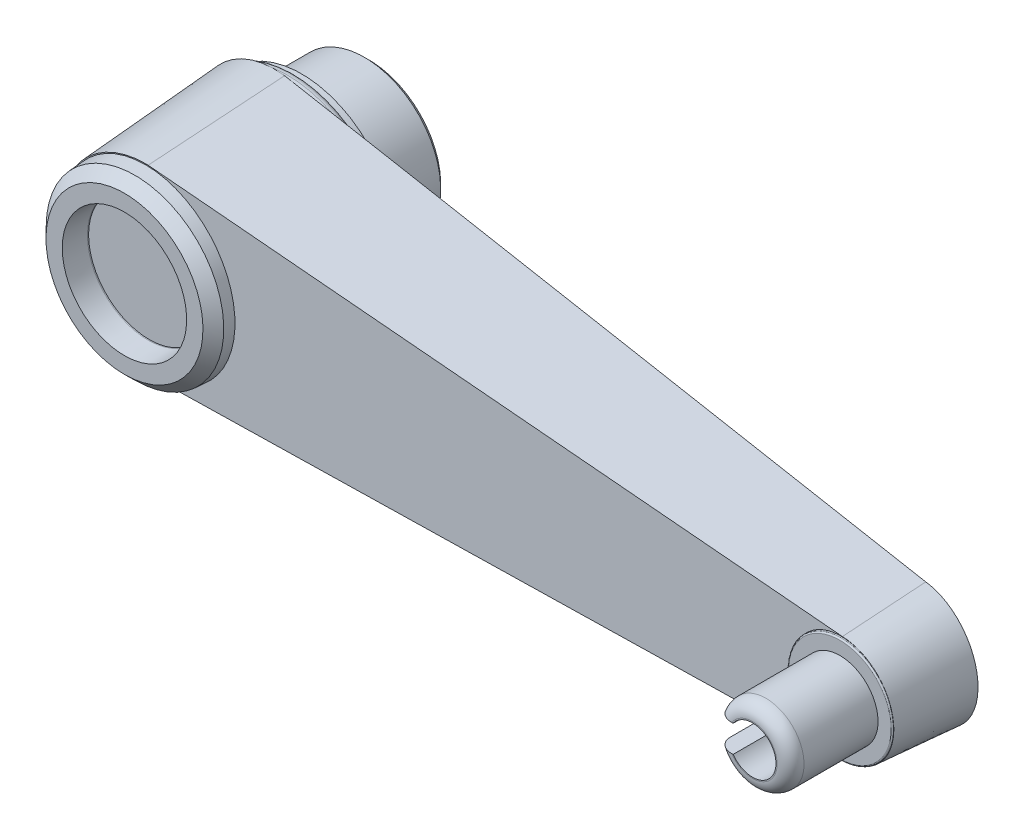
ISO-10303-21;
HEADER;
FILE_DESCRIPTION(('STEP AP214'),'2;1');
FILE_NAME('part.step','',(''),(''),'','','');
FILE_SCHEMA(('AUTOMOTIVE_DESIGN { 1 0 10303 214 1 1 1 1 }'));
ENDSEC;
DATA;
#1=APPLICATION_CONTEXT('core data for automotive mechanical design processes');
#2=APPLICATION_PROTOCOL_DEFINITION('international standard','automotive_design',2000,#1);
#3=PRODUCT_CONTEXT('',#1,'mechanical');
#4=PRODUCT('Part','Part','',(#3));
#5=PRODUCT_RELATED_PRODUCT_CATEGORY('part','',(#4));
#6=PRODUCT_DEFINITION_FORMATION('','',#4);
#7=PRODUCT_DEFINITION_CONTEXT('part definition',#1,'design');
#8=PRODUCT_DEFINITION('design','',#6,#7);
#9=PRODUCT_DEFINITION_SHAPE('','',#8);
#10=(LENGTH_UNIT() NAMED_UNIT(*) SI_UNIT(.MILLI.,.METRE.));
#11=(NAMED_UNIT(*) PLANE_ANGLE_UNIT() SI_UNIT($,.RADIAN.));
#12=(NAMED_UNIT(*) SI_UNIT($,.STERADIAN.) SOLID_ANGLE_UNIT());
#13=UNCERTAINTY_MEASURE_WITH_UNIT(LENGTH_MEASURE(1.E-05),#10,'distance_accuracy_value','');
#14=(GEOMETRIC_REPRESENTATION_CONTEXT(3) GLOBAL_UNCERTAINTY_ASSIGNED_CONTEXT((#13)) GLOBAL_UNIT_ASSIGNED_CONTEXT((#10,
#11,#12)) REPRESENTATION_CONTEXT('',''));
#15=CARTESIAN_POINT('',(0.,0.,0.));
#16=DIRECTION('',(0.,0.,1.));
#17=DIRECTION('',(1.,0.,0.));
#18=AXIS2_PLACEMENT_3D('',#15,#16,#17);
#19=CARTESIAN_POINT('',(160.,0.,61.5));
#20=DIRECTION('',(0.,0.,1.));
#21=DIRECTION('',(0.,-1.,0.));
#22=AXIS2_PLACEMENT_3D('',#19,#20,#21);
#23=CYLINDRICAL_SURFACE('',#22,5.25);
#24=CARTESIAN_POINT('',(158.,4.85412195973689,66.5));
#25=CARTESIAN_POINT('',(157.999995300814,4.85411749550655,66.3921322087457));
#26=CARTESIAN_POINT('',(158.008755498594,4.85775646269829,66.2842947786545));
#27=CARTESIAN_POINT('',(158.043398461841,4.8718124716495,66.0718794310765));
#28=CARTESIAN_POINT('',(158.069280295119,4.88222914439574,65.9673013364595));
#29=CARTESIAN_POINT('',(158.13707236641,4.90849299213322,65.7645346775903));
#30=CARTESIAN_POINT('',(158.178943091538,4.92432677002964,65.6663310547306));
#31=CARTESIAN_POINT('',(158.277383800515,4.95961884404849,65.478303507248));
#32=CARTESIAN_POINT('',(158.333958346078,4.97907826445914,65.3884821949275));
#33=CARTESIAN_POINT('',(158.463310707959,5.02054788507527,65.2151583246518));
#34=CARTESIAN_POINT('',(158.536721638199,5.04263475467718,65.1321464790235));
#35=CARTESIAN_POINT('',(158.69632078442,5.08623219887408,64.9792646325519));
#36=CARTESIAN_POINT('',(158.782511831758,5.1077426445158,64.9093975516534));
#37=CARTESIAN_POINT('',(158.968970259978,5.14867861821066,64.7824032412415));
#38=CARTESIAN_POINT('',(159.069626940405,5.16800383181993,64.7258123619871));
#39=CARTESIAN_POINT('',(159.279898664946,5.20146743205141,64.6305720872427));
#40=CARTESIAN_POINT('',(159.389510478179,5.21560767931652,64.5919162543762));
#41=CARTESIAN_POINT('',(159.609419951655,5.23656362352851,64.5353732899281));
#42=CARTESIAN_POINT('',(159.719471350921,5.24367649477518,64.5166406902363));
#43=CARTESIAN_POINT('',(159.941370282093,5.25084453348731,64.4977637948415));
#44=CARTESIAN_POINT('',(160.053217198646,5.25090206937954,64.4976132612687));
#45=CARTESIAN_POINT('',(160.269460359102,5.24414006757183,64.5154191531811));
#46=CARTESIAN_POINT('',(160.373945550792,5.23767132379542,64.5324519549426));
#47=CARTESIAN_POINT('',(160.578445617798,5.21904666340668,64.5825833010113));
#48=CARTESIAN_POINT('',(160.678460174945,5.20689034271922,64.6156829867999));
#49=CARTESIAN_POINT('',(160.872928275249,5.1778675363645,64.6974217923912));
#50=CARTESIAN_POINT('',(160.967278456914,5.16093443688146,64.7462821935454));
#51=CARTESIAN_POINT('',(161.146677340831,5.12406390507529,64.8579570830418));
#52=CARTESIAN_POINT('',(161.231722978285,5.10412548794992,64.9207761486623));
#53=CARTESIAN_POINT('',(161.39552833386,5.06187546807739,65.0630026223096));
#54=CARTESIAN_POINT('',(161.473601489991,5.03949325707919,65.1431809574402));
#55=CARTESIAN_POINT('',(161.615457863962,4.99582997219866,65.3156161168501));
#56=CARTESIAN_POINT('',(161.67923725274,4.97454919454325,65.4078761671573));
#57=CARTESIAN_POINT('',(161.792066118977,4.93504491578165,65.6046481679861));
#58=CARTESIAN_POINT('',(161.84073343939,4.9169051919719,65.7093974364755));
#59=CARTESIAN_POINT('',(161.919474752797,4.88670813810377,65.9264785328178));
#60=CARTESIAN_POINT('',(161.949559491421,4.87464729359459,66.0388059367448));
#61=CARTESIAN_POINT('',(161.988694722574,4.8588081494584,66.2610535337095));
#62=CARTESIAN_POINT('',(161.998839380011,4.85459969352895,66.3707501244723));
#63=CARTESIAN_POINT('',(162.000971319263,4.85372221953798,66.5903349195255));
#64=CARTESIAN_POINT('',(161.992963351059,4.85705122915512,66.7002230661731));
#65=CARTESIAN_POINT('',(161.960010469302,4.87043562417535,66.9113538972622));
#66=CARTESIAN_POINT('',(161.935925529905,4.88014911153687,67.0127550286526));
#67=CARTESIAN_POINT('',(161.872592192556,4.90479814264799,67.2100257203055));
#68=CARTESIAN_POINT('',(161.833340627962,4.91973477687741,67.3058941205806));
#69=CARTESIAN_POINT('',(161.739101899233,4.95384902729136,67.493458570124));
#70=CARTESIAN_POINT('',(161.683570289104,4.97316700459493,67.5848547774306));
#71=CARTESIAN_POINT('',(161.55892165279,5.01363658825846,67.7574189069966));
#72=CARTESIAN_POINT('',(161.489799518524,5.03478888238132,67.8385829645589));
#73=CARTESIAN_POINT('',(161.334553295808,5.07822530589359,67.9939211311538));
#74=CARTESIAN_POINT('',(161.247609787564,5.10049233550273,68.0672839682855));
#75=CARTESIAN_POINT('',(161.062102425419,5.14232121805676,68.198482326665));
#76=CARTESIAN_POINT('',(160.963538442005,5.16188304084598,68.2563176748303));
#77=CARTESIAN_POINT('',(160.757563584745,5.19609977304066,68.3544728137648));
#78=CARTESIAN_POINT('',(160.650178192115,5.21076823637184,68.3948410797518));
#79=CARTESIAN_POINT('',(160.429452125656,5.23357944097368,68.4567038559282));
#80=CARTESIAN_POINT('',(160.316114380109,5.24172535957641,68.4782075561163));
#81=CARTESIAN_POINT('',(160.094021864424,5.25026368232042,68.5007163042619));
#82=CARTESIAN_POINT('',(159.985399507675,5.25109150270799,68.5028726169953));
#83=CARTESIAN_POINT('',(159.769403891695,5.24604518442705,68.4896051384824));
#84=CARTESIAN_POINT('',(159.662030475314,5.24017189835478,68.4741835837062));
#85=CARTESIAN_POINT('',(159.454402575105,5.22258663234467,68.4270106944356));
#86=CARTESIAN_POINT('',(159.354035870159,5.21102929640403,68.3956912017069));
#87=CARTESIAN_POINT('',(159.159979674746,5.18328887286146,68.3180468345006));
#88=CARTESIAN_POINT('',(159.066291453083,5.16710490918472,68.2717191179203));
#89=CARTESIAN_POINT('',(158.883874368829,5.13086553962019,68.163131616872));
#90=CARTESIAN_POINT('',(158.795527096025,5.11067452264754,68.1002769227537));
#91=CARTESIAN_POINT('',(158.630282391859,5.06889045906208,67.9613473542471));
#92=CARTESIAN_POINT('',(158.553389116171,5.04729690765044,67.8852677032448));
#93=CARTESIAN_POINT('',(158.408885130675,5.00368509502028,67.7170882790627));
#94=CARTESIAN_POINT('',(158.342015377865,4.98170855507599,67.6243384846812));
#95=CARTESIAN_POINT('',(158.22476824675,4.94114513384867,67.4282270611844));
#96=CARTESIAN_POINT('',(158.174393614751,4.92255881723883,67.3248636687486));
#97=CARTESIAN_POINT('',(158.089514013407,4.89027069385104,67.1040015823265));
#98=CARTESIAN_POINT('',(158.056090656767,4.87691202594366,66.9860315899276));
#99=CARTESIAN_POINT('',(158.011344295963,4.85884331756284,66.7453589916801));
#100=CARTESIAN_POINT('',(158.000005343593,4.85412703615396,66.6226598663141));
#101=CARTESIAN_POINT('',(158.,4.85412195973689,66.5));
#102=B_SPLINE_CURVE_WITH_KNOTS('',3,(#24,#25,#26,#27,#28,#29,#30,#31,#32,#33,#34,#35,#36,#37,
#38,#39,#40,#41,#42,#43,#44,#45,#46,#47,#48,#49,#50,#51,#52,#53,#54,#55,#56,#57,#58,#59,#60,#61,
#62,#63,#64,#65,#66,#67,#68,#69,#70,#71,#72,#73,#74,#75,#76,#77,#78,#79,#80,#81,#82,#83,#84,#85,
#86,#87,#88,#89,#90,#91,#92,#93,#94,#95,#96,#97,#98,#99,#100,#101),.UNSPECIFIED.,.T.,.F.,(4,2,2,
2,2,2,2,2,2,2,2,2,2,2,2,2,2,2,2,2,2,2,2,2,2,2,2,2,2,2,2,2,2,2,2,2,2,2,4),(0.,0.32314625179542,
0.646274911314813,0.968610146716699,1.2910455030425,1.62853280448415,1.9660949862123,
2.31556495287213,2.66490938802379,2.99875215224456,3.33248284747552,3.64918294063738,
3.96590553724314,4.28728404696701,4.60876809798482,4.94960433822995,5.29053177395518,
5.63948604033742,5.98823832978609,6.31725114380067,6.64617787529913,6.95878611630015,
7.27145966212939,7.59609264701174,7.92084788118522,8.26697057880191,8.61309713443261,
8.95825684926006,9.30324832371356,9.62756420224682,9.95183882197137,10.26774207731,
10.5837051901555,10.9131356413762,11.2426853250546,11.5903196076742,11.9380117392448,
12.3057371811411,12.673196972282),.UNSPECIFIED.);
#103=CARTESIAN_POINT('',(158.,4.85412195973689,66.5));
#104=VERTEX_POINT('',#103);
#105=EDGE_CURVE('E28',#104,#104,#102,.T.);
#106=ORIENTED_EDGE('',*,*,#105,.F.);
#107=EDGE_LOOP('',(#106));
#108=FACE_BOUND('',#107,.T.);
#109=DIRECTION('',(0.,0.,1.));
#110=VECTOR('',#109,1.);
#111=CARTESIAN_POINT('',(155.691578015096,-2.99999999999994,61.5));
#112=LINE('',#111,#110);
#113=CARTESIAN_POINT('',(155.691578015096,-2.99999999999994,61.5));
#114=VERTEX_POINT('',#113);
#115=CARTESIAN_POINT('',(155.691578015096,-2.99999999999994,74.5));
#116=VERTEX_POINT('',#115);
#117=EDGE_CURVE('E131',#114,#116,#112,.T.);
#118=ORIENTED_EDGE('',*,*,#117,.T.);
#119=CARTESIAN_POINT('',(160.,0.,74.5));
#120=DIRECTION('',(0.,0.,1.));
#121=DIRECTION('',(0.,-1.,0.));
#122=AXIS2_PLACEMENT_3D('',#119,#120,#121);
#123=CIRCLE('',#122,5.25);
#124=CARTESIAN_POINT('',(155.691578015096,2.99999999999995,74.5));
#125=VERTEX_POINT('',#124);
#126=EDGE_CURVE('E135',#116,#125,#123,.T.);
#127=ORIENTED_EDGE('',*,*,#126,.T.);
#128=DIRECTION('',(0.,0.,1.));
#129=VECTOR('',#128,1.);
#130=CARTESIAN_POINT('',(155.691578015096,2.99999999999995,61.5));
#131=LINE('',#130,#129);
#132=CARTESIAN_POINT('',(155.691578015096,2.99999999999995,61.5));
#133=VERTEX_POINT('',#132);
#134=EDGE_CURVE('E141',#133,#125,#131,.T.);
#135=ORIENTED_EDGE('',*,*,#134,.F.);
#136=CARTESIAN_POINT('',(160.,0.,61.5));
#137=DIRECTION('',(0.,0.,1.));
#138=DIRECTION('',(0.,-1.,0.));
#139=AXIS2_PLACEMENT_3D('',#136,#137,#138);
#140=CIRCLE('',#139,5.25);
#141=EDGE_CURVE('E137',#114,#133,#140,.T.);
#142=ORIENTED_EDGE('',*,*,#141,.F.);
#143=EDGE_LOOP('',(#118,#127,#135,#142));
#144=FACE_BOUND('',#143,.T.);
#145=CARTESIAN_POINT('',(158.,-4.8541219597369,66.5));
#146=CARTESIAN_POINT('',(157.999995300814,-4.85411749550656,66.6078677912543));
#147=CARTESIAN_POINT('',(158.008755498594,-4.8577564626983,66.7157052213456));
#148=CARTESIAN_POINT('',(158.043398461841,-4.8718124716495,66.9281205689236));
#149=CARTESIAN_POINT('',(158.069280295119,-4.88222914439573,67.0326986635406));
#150=CARTESIAN_POINT('',(158.13707236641,-4.90849299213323,67.2354653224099));
#151=CARTESIAN_POINT('',(158.178943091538,-4.92432677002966,67.3336689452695));
#152=CARTESIAN_POINT('',(158.277383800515,-4.95961884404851,67.5216964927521));
#153=CARTESIAN_POINT('',(158.333958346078,-4.97907826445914,67.6115178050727));
#154=CARTESIAN_POINT('',(158.463310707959,-5.02054788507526,67.7848416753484));
#155=CARTESIAN_POINT('',(158.536721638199,-5.04263475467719,67.8678535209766));
#156=CARTESIAN_POINT('',(158.69632078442,-5.08623219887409,68.0207353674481));
#157=CARTESIAN_POINT('',(158.782511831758,-5.10774264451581,68.0906024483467));
#158=CARTESIAN_POINT('',(158.968970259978,-5.14867861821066,68.2175967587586));
#159=CARTESIAN_POINT('',(159.069626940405,-5.16800383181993,68.2741876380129));
#160=CARTESIAN_POINT('',(159.279898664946,-5.20146743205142,68.3694279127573));
#161=CARTESIAN_POINT('',(159.389510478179,-5.21560767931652,68.4080837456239));
#162=CARTESIAN_POINT('',(159.609419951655,-5.23656362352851,68.4646267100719));
#163=CARTESIAN_POINT('',(159.719471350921,-5.24367649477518,68.4833593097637));
#164=CARTESIAN_POINT('',(159.941370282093,-5.25084453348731,68.5022362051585));
#165=CARTESIAN_POINT('',(160.053217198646,-5.25090206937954,68.5023867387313));
#166=CARTESIAN_POINT('',(160.269460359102,-5.24414006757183,68.4845808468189));
#167=CARTESIAN_POINT('',(160.373945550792,-5.23767132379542,68.4675480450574));
#168=CARTESIAN_POINT('',(160.578445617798,-5.21904666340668,68.4174166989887));
#169=CARTESIAN_POINT('',(160.678460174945,-5.20689034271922,68.3843170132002));
#170=CARTESIAN_POINT('',(160.872928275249,-5.17786753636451,68.302578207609));
#171=CARTESIAN_POINT('',(160.967278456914,-5.16093443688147,68.2537178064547));
#172=CARTESIAN_POINT('',(161.146677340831,-5.1240639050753,68.1420429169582));
#173=CARTESIAN_POINT('',(161.231722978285,-5.10412548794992,68.0792238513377));
#174=CARTESIAN_POINT('',(161.39552833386,-5.06187546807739,67.9369973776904));
#175=CARTESIAN_POINT('',(161.473601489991,-5.03949325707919,67.8568190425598));
#176=CARTESIAN_POINT('',(161.615457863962,-4.99582997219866,67.68438388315));
#177=CARTESIAN_POINT('',(161.67923725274,-4.97454919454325,67.5921238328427));
#178=CARTESIAN_POINT('',(161.792066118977,-4.93504491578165,67.3953518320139));
#179=CARTESIAN_POINT('',(161.84073343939,-4.9169051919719,67.2906025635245));
#180=CARTESIAN_POINT('',(161.919474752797,-4.88670813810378,67.0735214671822));
#181=CARTESIAN_POINT('',(161.949559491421,-4.87464729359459,66.9611940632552));
#182=CARTESIAN_POINT('',(161.988694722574,-4.8588081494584,66.7389464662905));
#183=CARTESIAN_POINT('',(161.998839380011,-4.85459969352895,66.6292498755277));
#184=CARTESIAN_POINT('',(162.000971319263,-4.85372221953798,66.4096650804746));
#185=CARTESIAN_POINT('',(161.992963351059,-4.85705122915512,66.2997769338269));
#186=CARTESIAN_POINT('',(161.960010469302,-4.87043562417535,66.0886461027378));
#187=CARTESIAN_POINT('',(161.935925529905,-4.88014911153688,65.9872449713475));
#188=CARTESIAN_POINT('',(161.872592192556,-4.904798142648,65.7899742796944));
#189=CARTESIAN_POINT('',(161.833340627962,-4.91973477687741,65.6941058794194));
#190=CARTESIAN_POINT('',(161.739101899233,-4.95384902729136,65.506541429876));
#191=CARTESIAN_POINT('',(161.683570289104,-4.97316700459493,65.4151452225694));
#192=CARTESIAN_POINT('',(161.55892165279,-5.01363658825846,65.2425810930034));
#193=CARTESIAN_POINT('',(161.489799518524,-5.03478888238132,65.1614170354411));
#194=CARTESIAN_POINT('',(161.334553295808,-5.07822530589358,65.0060788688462));
#195=CARTESIAN_POINT('',(161.247609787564,-5.10049233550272,64.9327160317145));
#196=CARTESIAN_POINT('',(161.062102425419,-5.14232121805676,64.8015176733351));
#197=CARTESIAN_POINT('',(160.963538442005,-5.16188304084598,64.7436823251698));
#198=CARTESIAN_POINT('',(160.757563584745,-5.19609977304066,64.6455271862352));
#199=CARTESIAN_POINT('',(160.650178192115,-5.21076823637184,64.6051589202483));
#200=CARTESIAN_POINT('',(160.429452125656,-5.23357944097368,64.5432961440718));
#201=CARTESIAN_POINT('',(160.316114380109,-5.24172535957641,64.5217924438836));
#202=CARTESIAN_POINT('',(160.094021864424,-5.25026368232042,64.4992836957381));
#203=CARTESIAN_POINT('',(159.985399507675,-5.25109150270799,64.4971273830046));
#204=CARTESIAN_POINT('',(159.769403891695,-5.24604518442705,64.5103948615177));
#205=CARTESIAN_POINT('',(159.662030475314,-5.24017189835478,64.5258164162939));
#206=CARTESIAN_POINT('',(159.454402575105,-5.22258663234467,64.5729893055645));
#207=CARTESIAN_POINT('',(159.354035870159,-5.21102929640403,64.6043087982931));
#208=CARTESIAN_POINT('',(159.159979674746,-5.18328887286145,64.6819531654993));
#209=CARTESIAN_POINT('',(159.066291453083,-5.16710490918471,64.7282808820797));
#210=CARTESIAN_POINT('',(158.883874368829,-5.1308655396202,64.8368683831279));
#211=CARTESIAN_POINT('',(158.795527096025,-5.11067452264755,64.8997230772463));
#212=CARTESIAN_POINT('',(158.630282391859,-5.06889045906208,65.0386526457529));
#213=CARTESIAN_POINT('',(158.553389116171,-5.04729690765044,65.1147322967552));
#214=CARTESIAN_POINT('',(158.408885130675,-5.00368509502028,65.2829117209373));
#215=CARTESIAN_POINT('',(158.342015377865,-4.98170855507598,65.3756615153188));
#216=CARTESIAN_POINT('',(158.22476824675,-4.94114513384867,65.5717729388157));
#217=CARTESIAN_POINT('',(158.174393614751,-4.92255881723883,65.6751363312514));
#218=CARTESIAN_POINT('',(158.089514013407,-4.89027069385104,65.8959984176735));
#219=CARTESIAN_POINT('',(158.056090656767,-4.87691202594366,66.0139684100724));
#220=CARTESIAN_POINT('',(158.011344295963,-4.85884331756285,66.2546410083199));
#221=CARTESIAN_POINT('',(158.000005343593,-4.85412703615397,66.3773401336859));
#222=CARTESIAN_POINT('',(158.,-4.8541219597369,66.5));
#223=B_SPLINE_CURVE_WITH_KNOTS('',3,(#145,#146,#147,#148,#149,#150,#151,#152,#153,#154,#155,
#156,#157,#158,#159,#160,#161,#162,#163,#164,#165,#166,#167,#168,#169,#170,#171,#172,#173,#174,
#175,#176,#177,#178,#179,#180,#181,#182,#183,#184,#185,#186,#187,#188,#189,#190,#191,#192,#193,
#194,#195,#196,#197,#198,#199,#200,#201,#202,#203,#204,#205,#206,#207,#208,#209,#210,#211,#212,
#213,#214,#215,#216,#217,#218,#219,#220,#221,#222),.UNSPECIFIED.,.T.,.F.,(4,2,2,2,2,2,2,2,2,2,2,
2,2,2,2,2,2,2,2,2,2,2,2,2,2,2,2,2,2,2,2,2,2,2,2,2,2,2,4),(0.,0.323146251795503,
0.646274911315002,0.968610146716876,1.29104550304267,1.62853280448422,1.96609498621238,
2.31556495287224,2.66490938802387,2.99875215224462,3.33248284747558,3.64918294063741,
3.96590553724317,4.28728404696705,4.6087680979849,4.94960433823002,5.29053177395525,
5.63948604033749,5.98823832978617,6.31725114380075,6.64617787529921,6.95878611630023,
7.27145966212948,7.59609264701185,7.9208478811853,8.26697057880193,8.61309713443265,
8.95825684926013,9.30324832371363,9.62756420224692,9.95183882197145,10.26774207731,
10.5837051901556,10.9131356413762,11.2426853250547,11.5903196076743,11.9380117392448,
12.3057371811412,12.6731969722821),.UNSPECIFIED.);
#224=CARTESIAN_POINT('',(158.,-4.8541219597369,66.5));
#225=VERTEX_POINT('',#224);
#226=EDGE_CURVE('E9',#225,#225,#223,.T.);
#227=ORIENTED_EDGE('',*,*,#226,.F.);
#228=EDGE_LOOP('',(#227));
#229=FACE_BOUND('',#228,.T.);
#230=ADVANCED_FACE('F14',(#108,#144,#229),#23,.F.);
#231=CARTESIAN_POINT('',(-16.,0.,0.));
#232=DIRECTION('',(0.,0.,-1.));
#233=DIRECTION('',(0.,1.,0.));
#234=AXIS2_PLACEMENT_3D('',#231,#232,#233);
#235=PLANE('',#234);
#236=CARTESIAN_POINT('',(0.,0.,0.));
#237=DIRECTION('',(0.,0.,1.));
#238=DIRECTION('',(0.,-1.,0.));
#239=AXIS2_PLACEMENT_3D('',#236,#237,#238);
#240=CIRCLE('',#239,16.);
#241=CARTESIAN_POINT('',(0.,-16.,0.));
#242=VERTEX_POINT('',#241);
#243=EDGE_CURVE('E724',#242,#242,#240,.T.);
#244=ORIENTED_EDGE('',*,*,#243,.F.);
#245=EDGE_LOOP('',(#244));
#246=FACE_BOUND('',#245,.T.);
#247=CARTESIAN_POINT('',(0.,0.,0.));
#248=DIRECTION('',(0.,0.,1.));
#249=DIRECTION('',(0.,-1.,0.));
#250=AXIS2_PLACEMENT_3D('',#247,#248,#249);
#251=CIRCLE('',#250,6.);
#252=CARTESIAN_POINT('',(0.,-6.,0.));
#253=VERTEX_POINT('',#252);
#254=EDGE_CURVE('E700',#253,#253,#251,.T.);
#255=ORIENTED_EDGE('',*,*,#254,.T.);
#256=EDGE_LOOP('',(#255));
#257=FACE_BOUND('',#256,.T.);
#258=ADVANCED_FACE('F187',(#246,#257),#235,.T.);
#259=CARTESIAN_POINT('',(-17.5,0.,54.5));
#260=DIRECTION('',(0.,0.,-1.));
#261=DIRECTION('',(0.,1.,0.));
#262=AXIS2_PLACEMENT_3D('',#259,#260,#261);
#263=PLANE('',#262);
#264=CARTESIAN_POINT('',(0.,0.,54.5));
#265=DIRECTION('',(0.,0.,1.));
#266=DIRECTION('',(0.,-1.,0.));
#267=AXIS2_PLACEMENT_3D('',#264,#265,#266);
#268=CIRCLE('',#267,17.5);
#269=CARTESIAN_POINT('',(0.,-17.5,54.5));
#270=VERTEX_POINT('',#269);
#271=EDGE_CURVE('E721',#270,#270,#268,.T.);
#272=ORIENTED_EDGE('',*,*,#271,.T.);
#273=EDGE_LOOP('',(#272));
#274=FACE_BOUND('',#273,.T.);
#275=CARTESIAN_POINT('',(0.,0.,54.5));
#276=DIRECTION('',(0.,0.,1.));
#277=DIRECTION('',(-1.,0.,0.));
#278=AXIS2_PLACEMENT_3D('',#275,#276,#277);
#279=CIRCLE('',#278,13.8671157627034);
#280=CARTESIAN_POINT('',(-13.8671157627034,0.,54.5));
#281=VERTEX_POINT('',#280);
#282=EDGE_CURVE('E705',#281,#281,#279,.T.);
#283=ORIENTED_EDGE('',*,*,#282,.F.);
#284=EDGE_LOOP('',(#283));
#285=FACE_BOUND('',#284,.T.);
#286=ADVANCED_FACE('F257',(#274,#285),#263,.F.);
#287=CARTESIAN_POINT('',(171.778648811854,-22.5,54.7663067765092));
#288=DIRECTION('',(0.0325737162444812,0.,-0.999469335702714));
#289=DIRECTION('',(0.999469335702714,0.,0.0325737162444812));
#290=AXIS2_PLACEMENT_3D('',#287,#288,#289);
#291=PLANE('',#290);
#292=CARTESIAN_POINT('',(159.97308710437,0.,54.3815515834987));
#293=DIRECTION('',(0.0325737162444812,0.,-0.999469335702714));
#294=DIRECTION('',(-0.999469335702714,0.,-0.0325737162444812));
#295=AXIS2_PLACEMENT_3D('',#292,#293,#294);
#296=ELLIPSE('',#295,11.8154261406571,11.8091254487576);
#297=CARTESIAN_POINT('',(159.93673230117,11.809069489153,54.380366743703));
#298=VERTEX_POINT('',#297);
#299=CARTESIAN_POINT('',(171.778648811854,0.291342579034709,54.7663067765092));
#300=VERTEX_POINT('',#299);
#301=EDGE_CURVE('E413',#298,#300,#296,.T.);
#302=ORIENTED_EDGE('',*,*,#301,.F.);
#303=DIRECTION('',(0.998096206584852,-0.0524006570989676,0.0325289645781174));
#304=VECTOR('',#303,1.);
#305=CARTESIAN_POINT('',(173.540528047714,11.0948619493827,54.8237282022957));
#306=LINE('',#305,#304);
#307=CARTESIAN_POINT('',(-0.0559505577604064,20.2087825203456,49.166043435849));
#308=VERTEX_POINT('',#307);
#309=EDGE_CURVE('E326',#298,#308,#306,.F.);
#310=ORIENTED_EDGE('',*,*,#309,.T.);
#311=CARTESIAN_POINT('',(-0.0460556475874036,0.,49.1663659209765));
#312=DIRECTION('',(0.0325737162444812,0.,-0.999469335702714));
#313=DIRECTION('',(-0.999469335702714,0.,-0.0325737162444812));
#314=AXIS2_PLACEMENT_3D('',#311,#312,#313);
#315=ELLIPSE('',#314,20.2195672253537,20.2087849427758);
#316=CARTESIAN_POINT('',(-20.254807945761,0.0586559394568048,48.5077422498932));
#317=VERTEX_POINT('',#316);
#318=EDGE_CURVE('E332',#308,#317,#315,.F.);
#319=ORIENTED_EDGE('',*,*,#318,.T.);
#320=DIRECTION('',(0.,1.,0.));
#321=VECTOR('',#320,1.);
#322=CARTESIAN_POINT('',(-20.254807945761,-22.5,48.5077422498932));
#323=LINE('',#322,#321);
#324=CARTESIAN_POINT('',(-20.254807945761,-0.0586559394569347,48.5077422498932));
#325=VERTEX_POINT('',#324);
#326=EDGE_CURVE('E329',#325,#317,#323,.T.);
#327=ORIENTED_EDGE('',*,*,#326,.F.);
#328=CARTESIAN_POINT('',(-0.0559505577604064,-20.2087825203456,49.166043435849));
#329=VERTEX_POINT('',#328);
#330=EDGE_CURVE('E425',#325,#329,#315,.F.);
#331=ORIENTED_EDGE('',*,*,#330,.T.);
#332=DIRECTION('',(-0.998096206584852,-0.0524006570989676,-0.0325289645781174));
#333=VECTOR('',#332,1.);
#334=CARTESIAN_POINT('',(171.186987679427,-11.2184242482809,54.7470239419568));
#335=LINE('',#334,#333);
#336=CARTESIAN_POINT('',(159.93673230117,-11.809069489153,54.380366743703));
#337=VERTEX_POINT('',#336);
#338=EDGE_CURVE('E416',#329,#337,#335,.F.);
#339=ORIENTED_EDGE('',*,*,#338,.T.);
#340=CARTESIAN_POINT('',(171.778648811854,-0.291342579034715,54.7663067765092));
#341=VERTEX_POINT('',#340);
#342=EDGE_CURVE('E381',#341,#337,#296,.T.);
#343=ORIENTED_EDGE('',*,*,#342,.F.);
#344=DIRECTION('',(0.,1.,0.));
#345=VECTOR('',#344,1.);
#346=CARTESIAN_POINT('',(171.778648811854,-22.5,54.7663067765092));
#347=LINE('',#346,#345);
#348=EDGE_CURVE('E321',#341,#300,#347,.T.);
#349=ORIENTED_EDGE('',*,*,#348,.T.);
#350=EDGE_LOOP('',(#302,#310,#319,#327,#331,#339,#343,#349));
#351=FACE_BOUND('',#350,.T.);
#352=CARTESIAN_POINT('',(160.,0.,54.3824287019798));
#353=DIRECTION('',(0.0325737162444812,0.,-0.999469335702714));
#354=DIRECTION('',(0.999469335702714,0.,0.0325737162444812));
#355=AXIS2_PLACEMENT_3D('',#352,#353,#354);
#356=ELLIPSE('',#355,11.740407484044,11.7341772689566);
#357=CARTESIAN_POINT('',(169.744137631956,-6.53778999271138,54.7));
#358=VERTEX_POINT('',#357);
#359=CARTESIAN_POINT('',(169.744137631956,6.53778999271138,54.7));
#360=VERTEX_POINT('',#359);
#361=EDGE_CURVE('E297',#358,#360,#356,.T.);
#362=ORIENTED_EDGE('',*,*,#361,.T.);
#363=CARTESIAN_POINT('',(169.738000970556,6.5469268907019,54.6998));
#364=CARTESIAN_POINT('',(169.849612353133,6.38094200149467,54.7034375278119));
#365=CARTESIAN_POINT('',(169.956930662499,6.21201947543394,54.7069351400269));
#366=CARTESIAN_POINT('',(170.266807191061,5.69523602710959,54.7170343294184));
#367=CARTESIAN_POINT('',(170.455907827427,5.33919821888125,54.723197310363));
#368=CARTESIAN_POINT('',(170.796554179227,4.60901408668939,54.734299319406));
#369=CARTESIAN_POINT('',(170.948047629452,4.23484341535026,54.7392366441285));
#370=CARTESIAN_POINT('',(171.187972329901,3.54158413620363,54.7470560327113));
#371=CARTESIAN_POINT('',(171.282847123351,3.22471076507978,54.7501480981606));
#372=CARTESIAN_POINT('',(171.44561966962,2.58398407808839,54.7554530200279));
#373=CARTESIAN_POINT('',(171.513509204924,2.26012866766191,54.7576656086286));
#374=CARTESIAN_POINT('',(171.621871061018,1.60766643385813,54.7611972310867));
#375=CARTESIAN_POINT('',(171.662327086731,1.27905690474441,54.762515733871));
#376=CARTESIAN_POINT('',(171.715521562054,0.619449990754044,54.7642493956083));
#377=CARTESIAN_POINT('',(171.728247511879,0.288451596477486,54.7646641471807));
#378=CARTESIAN_POINT('',(171.725864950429,-0.373795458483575,54.764586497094));
#379=CARTESIAN_POINT('',(171.71072691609,-0.705044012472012,54.7640931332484));
#380=CARTESIAN_POINT('',(171.652663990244,-1.36494867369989,54.7622008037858));
#381=CARTESIAN_POINT('',(171.609751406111,-1.69360586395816,54.7608022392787));
#382=CARTESIAN_POINT('',(171.496440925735,-2.34601254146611,54.7571093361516));
#383=CARTESIAN_POINT('',(171.426053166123,-2.66976379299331,54.7548153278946));
#384=CARTESIAN_POINT('',(171.258235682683,-3.31013345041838,54.7493459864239));
#385=CARTESIAN_POINT('',(171.160811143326,-3.62675321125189,54.7461708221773));
#386=CARTESIAN_POINT('',(170.968605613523,-4.16868514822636,54.7399066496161));
#387=CARTESIAN_POINT('',(170.879840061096,-4.39615433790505,54.737013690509));
#388=CARTESIAN_POINT('',(170.688259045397,-4.84508421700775,54.730769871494));
#389=CARTESIAN_POINT('',(170.585444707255,-5.06654538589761,54.7274190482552));
#390=CARTESIAN_POINT('',(170.366217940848,-5.5023897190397,54.7202742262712));
#391=CARTESIAN_POINT('',(170.249816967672,-5.71677865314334,54.7164806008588));
#392=CARTESIAN_POINT('',(170.003749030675,-6.13785701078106,54.7084609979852));
#393=CARTESIAN_POINT('',(169.874079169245,-6.3445447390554,54.7042349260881));
#394=CARTESIAN_POINT('',(169.738000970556,-6.5469268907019,54.6998));
#395=B_SPLINE_CURVE_WITH_KNOTS('',3,(#363,#364,#365,#366,#367,#368,#369,#370,#371,#372,#373,
#374,#375,#376,#377,#378,#379,#380,#381,#382,#383,#384,#385,#386,#387,#388,#389,#390,#391,#392,
#393,#394),.UNSPECIFIED.,.F.,.F.,(4,2,2,2,2,2,2,2,2,2,2,2,2,2,2,4),(0.,0.600201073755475,
1.80746577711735,3.01639901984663,4.00761988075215,4.9991423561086,5.9912532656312,
6.9838112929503,7.97742158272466,8.97059188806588,9.9633961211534,10.95601010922,
11.688140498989,12.4202122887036,13.1516712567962,13.8832903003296),.UNSPECIFIED.);
#396=EDGE_CURVE('E289',#360,#358,#395,.T.);
#397=ORIENTED_EDGE('',*,*,#396,.T.);
#398=EDGE_LOOP('',(#362,#397));
#399=FACE_BOUND('',#398,.T.);
#400=CARTESIAN_POINT('',(-0.0455853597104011,0.,49.166381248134));
#401=DIRECTION('',(0.0325737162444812,0.,-0.999469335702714));
#402=DIRECTION('',(-0.999469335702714,0.,-0.0325737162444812));
#403=AXIS2_PLACEMENT_3D('',#400,#401,#402);
#404=ELLIPSE('',#403,20.0130992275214,20.0024270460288);
#405=CARTESIAN_POINT('',(-20.0480643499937,0.,48.5144802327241));
#406=VERTEX_POINT('',#405);
#407=EDGE_CURVE('E233',#406,#406,#404,.F.);
#408=ORIENTED_EDGE('',*,*,#407,.F.);
#409=EDGE_LOOP('',(#408));
#410=FACE_BOUND('',#409,.T.);
#411=ADVANCED_FACE('F260',(#351,#399,#410),#291,.F.);
#412=CARTESIAN_POINT('',(-22.499915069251,-22.5,16.4012145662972));
#413=DIRECTION('',(-0.997564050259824,0.,0.069756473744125));
#414=DIRECTION('',(-0.069756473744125,0.,-0.997564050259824));
#415=AXIS2_PLACEMENT_3D('',#412,#413,#414);
#416=PLANE('',#415);
#417=CARTESIAN_POINT('',(-20.2547939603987,-0.0586559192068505,48.5079422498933));
#418=CARTESIAN_POINT('',(-20.6289831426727,-0.0591973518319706,43.1567876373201));
#419=CARTESIAN_POINT('',(-21.0031723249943,-0.0597318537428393,37.8056330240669));
#420=CARTESIAN_POINT('',(-21.7515506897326,-0.0607869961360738,27.1033237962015));
#421=CARTESIAN_POINT('',(-22.1257398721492,-0.0613076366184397,21.7521691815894));
#422=CARTESIAN_POINT('',(-22.4999290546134,-0.0618213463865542,16.4010145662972));
#423=B_SPLINE_CURVE_WITH_KNOTS('',3,(#417,#418,#419,#420,#421,#422),.UNSPECIFIED.,.F.,.F.,(4,2,
4),(0.,16.0926648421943,32.1853296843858),.UNSPECIFIED.);
#424=CARTESIAN_POINT('',(-22.499915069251,-0.0618213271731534,16.4012145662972));
#425=VERTEX_POINT('',#424);
#426=EDGE_CURVE('E419',#325,#425,#423,.T.);
#427=ORIENTED_EDGE('',*,*,#426,.F.);
#428=ORIENTED_EDGE('',*,*,#326,.T.);
#429=CARTESIAN_POINT('',(-22.4999290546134,0.061821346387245,16.4010145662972));
#430=CARTESIAN_POINT('',(-22.1257398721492,0.0613076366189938,21.7521691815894));
#431=CARTESIAN_POINT('',(-21.7515506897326,0.0607869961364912,27.1033237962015));
#432=CARTESIAN_POINT('',(-21.0031723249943,0.059731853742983,37.8056330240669));
#433=CARTESIAN_POINT('',(-20.6289831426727,0.0591973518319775,43.1567876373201));
#434=CARTESIAN_POINT('',(-20.2547939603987,0.0586559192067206,48.5079422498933));
#435=B_SPLINE_CURVE_WITH_KNOTS('',3,(#429,#430,#431,#432,#433,#434),.UNSPECIFIED.,.F.,.F.,(4,2,
4),(0.,16.0926648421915,32.1853296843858),.UNSPECIFIED.);
#436=CARTESIAN_POINT('',(-22.499915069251,0.0618213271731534,16.4012145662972));
#437=VERTEX_POINT('',#436);
#438=EDGE_CURVE('E427',#437,#317,#435,.T.);
#439=ORIENTED_EDGE('',*,*,#438,.F.);
#440=DIRECTION('',(0.,1.,0.));
#441=VECTOR('',#440,1.);
#442=CARTESIAN_POINT('',(-22.499915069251,-22.5,16.4012145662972));
#443=LINE('',#442,#441);
#444=EDGE_CURVE('E325',#425,#437,#443,.T.);
#445=ORIENTED_EDGE('',*,*,#444,.F.);
#446=EDGE_LOOP('',(#427,#428,#439,#445));
#447=FACE_BOUND('',#446,.T.);
#448=ADVANCED_FACE('F16',(#447),#416,.T.);
#449=CARTESIAN_POINT('',(-22.499915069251,-22.5,16.4012145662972));
#450=DIRECTION('',(-0.1058879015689,0.,0.994378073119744));
#451=DIRECTION('',(-0.994378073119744,0.,-0.1058879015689));
#452=AXIS2_PLACEMENT_3D('',#449,#450,#451);
#453=PLANE('',#452);
#454=CARTESIAN_POINT('',(-0.164765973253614,0.,18.7796077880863));
#455=DIRECTION('',(-0.1058879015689,0.,0.994378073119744));
#456=DIRECTION('',(-0.994378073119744,0.,-0.1058879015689));
#457=AXIS2_PLACEMENT_3D('',#454,#455,#456);
#458=ELLIPSE('',#457,22.2524307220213,22.1267157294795);
#459=CARTESIAN_POINT('',(-5.73016630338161,21.4154053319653,18.1869674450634));
#460=VERTEX_POINT('',#459);
#461=CARTESIAN_POINT('',(-5.73016630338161,-21.4154053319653,18.1869674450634));
#462=VERTEX_POINT('',#461);
#463=EDGE_CURVE('E358',#460,#462,#458,.F.);
#464=ORIENTED_EDGE('',*,*,#463,.F.);
#465=CARTESIAN_POINT('',(-5.728288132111,21.4158932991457,18.1871674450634));
#466=CARTESIAN_POINT('',(-6.21145176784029,21.2904178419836,18.1357170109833));
#467=CARTESIAN_POINT('',(-6.68970169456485,21.1459504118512,18.0847898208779));
#468=CARTESIAN_POINT('',(-7.63406238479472,20.8202284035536,17.9842280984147));
#469=CARTESIAN_POINT('',(-8.10016362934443,20.6389459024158,17.9345945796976));
#470=CARTESIAN_POINT('',(-9.02197055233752,20.2389028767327,17.8364345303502));
#471=CARTESIAN_POINT('',(-9.47751635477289,20.0197699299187,17.7879250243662));
#472=CARTESIAN_POINT('',(-10.3706211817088,19.5468453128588,17.692821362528));
#473=CARTESIAN_POINT('',(-10.8081748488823,19.2930434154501,17.6462277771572));
#474=CARTESIAN_POINT('',(-11.6633618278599,18.7520881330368,17.5551618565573));
#475=CARTESIAN_POINT('',(-12.0809625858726,18.4648827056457,17.5106929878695));
#476=CARTESIAN_POINT('',(-12.8931796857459,17.8592858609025,17.4242027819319));
#477=CARTESIAN_POINT('',(-13.2877950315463,17.5408930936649,17.3821815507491));
#478=CARTESIAN_POINT('',(-14.0895973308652,16.8420068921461,17.2968003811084));
#479=CARTESIAN_POINT('',(-14.4941798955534,16.4584858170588,17.2537177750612));
#480=CARTESIAN_POINT('',(-15.2703352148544,15.658974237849,17.1710676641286));
#481=CARTESIAN_POINT('',(-15.64190424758,15.2429800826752,17.1315005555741));
#482=CARTESIAN_POINT('',(-16.349107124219,14.3821574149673,17.056192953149));
#483=CARTESIAN_POINT('',(-16.6847907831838,13.937370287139,17.0204471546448));
#484=CARTESIAN_POINT('',(-17.318680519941,13.0216453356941,16.9529464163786));
#485=CARTESIAN_POINT('',(-17.6168907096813,12.5507103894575,16.9211910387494));
#486=CARTESIAN_POINT('',(-18.1794412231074,11.5766567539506,16.8612869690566));
#487=CARTESIAN_POINT('',(-18.4430205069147,11.0730934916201,16.8332193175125));
#488=CARTESIAN_POINT('',(-18.9279644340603,10.045629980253,16.7815793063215));
#489=CARTESIAN_POINT('',(-19.1493156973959,9.52172334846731,16.758008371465));
#490=CARTESIAN_POINT('',(-19.5491349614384,8.45604860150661,16.7154329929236));
#491=CARTESIAN_POINT('',(-19.7274877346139,7.91423682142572,16.6964408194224));
#492=CARTESIAN_POINT('',(-20.0399003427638,6.81834520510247,16.6631730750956));
#493=CARTESIAN_POINT('',(-20.1739976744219,6.26427618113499,16.6488935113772));
#494=CARTESIAN_POINT('',(-20.3719890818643,5.27972570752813,16.6278100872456));
#495=CARTESIAN_POINT('',(-20.4449885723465,4.8510620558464,16.6200366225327));
#496=CARTESIAN_POINT('',(-20.5666292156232,3.99026006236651,16.6070835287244));
#497=CARTESIAN_POINT('',(-20.6152700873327,3.55812168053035,16.6019039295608));
#498=CARTESIAN_POINT('',(-20.6905717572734,2.6908981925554,16.5938853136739));
#499=CARTESIAN_POINT('',(-20.7171774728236,2.25580842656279,16.591052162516));
#500=CARTESIAN_POINT('',(-20.753357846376,1.3848914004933,16.5871994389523));
#501=CARTESIAN_POINT('',(-20.7629285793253,0.949063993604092,16.5861802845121));
#502=CARTESIAN_POINT('',(-20.7691710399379,0.295088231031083,16.5855155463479));
#503=CARTESIAN_POINT('',(-20.7698980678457,0.0769578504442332,16.5854381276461));
#504=CARTESIAN_POINT('',(-20.7687765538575,-0.359295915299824,16.585557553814));
#505=CARTESIAN_POINT('',(-20.7669280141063,-0.577419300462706,16.5857543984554));
#506=CARTESIAN_POINT('',(-20.7568935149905,-1.23168233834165,16.5868229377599));
#507=CARTESIAN_POINT('',(-20.7442194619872,-1.66777982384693,16.5881725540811));
#508=CARTESIAN_POINT('',(-20.7004504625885,-2.53816813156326,16.5928333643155));
#509=CARTESIAN_POINT('',(-20.6693954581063,-2.97246082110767,16.5961403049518));
#510=CARTESIAN_POINT('',(-20.5844885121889,-3.83878984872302,16.6051817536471));
#511=CARTESIAN_POINT('',(-20.5306402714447,-4.27082654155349,16.6109158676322));
#512=CARTESIAN_POINT('',(-20.4196399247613,-4.99199395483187,16.6227359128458));
#513=CARTESIAN_POINT('',(-20.3691821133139,-5.2821763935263,16.6281089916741));
#514=CARTESIAN_POINT('',(-20.2566881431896,-5.86023472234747,16.6400880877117));
#515=CARTESIAN_POINT('',(-20.1946526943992,-6.14811075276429,16.6466940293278));
#516=CARTESIAN_POINT('',(-19.9908526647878,-7.00784250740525,16.6683959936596));
#517=CARTESIAN_POINT('',(-19.831427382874,-7.57558493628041,16.6853726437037));
#518=CARTESIAN_POINT('',(-19.4663217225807,-8.69318853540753,16.7242514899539));
#519=CARTESIAN_POINT('',(-19.2608337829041,-9.24311350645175,16.7461331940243));
#520=CARTESIAN_POINT('',(-18.8041419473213,-10.3234385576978,16.7947647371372));
#521=CARTESIAN_POINT('',(-18.5529390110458,-10.8538390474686,16.821514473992));
#522=CARTESIAN_POINT('',(-18.0055887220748,-11.8923779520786,16.8797999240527));
#523=CARTESIAN_POINT('',(-17.7093293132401,-12.4004566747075,16.9113475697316));
#524=CARTESIAN_POINT('',(-17.0742745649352,-13.3889944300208,16.9789723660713));
#525=CARTESIAN_POINT('',(-16.7354772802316,-13.8694521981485,17.0150497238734));
#526=CARTESIAN_POINT('',(-16.0167033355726,-14.8002033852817,17.0915894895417));
#527=CARTESIAN_POINT('',(-15.6366249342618,-15.2504176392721,17.132062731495));
#528=CARTESIAN_POINT('',(-15.038382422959,-15.899214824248,17.1957675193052));
#529=CARTESIAN_POINT('',(-14.8342758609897,-16.1110643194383,17.2175021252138));
#530=CARTESIAN_POINT('',(-14.4169578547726,-16.5256137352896,17.2619408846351));
#531=CARTESIAN_POINT('',(-14.2037439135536,-16.7283111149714,17.2846453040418));
#532=CARTESIAN_POINT('',(-13.5642800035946,-17.3099562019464,17.352739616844));
#533=CARTESIAN_POINT('',(-13.1259980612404,-17.6756655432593,17.3994107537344));
#534=CARTESIAN_POINT('',(-12.219871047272,-18.3679375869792,17.4959011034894));
#535=CARTESIAN_POINT('',(-11.7520269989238,-18.6945016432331,17.5457202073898));
#536=CARTESIAN_POINT('',(-11.0311791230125,-19.1526488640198,17.6224808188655));
#537=CARTESIAN_POINT('',(-10.7879460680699,-19.2999618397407,17.6483818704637));
#538=CARTESIAN_POINT('',(-10.2954472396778,-19.5838521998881,17.700826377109));
#539=CARTESIAN_POINT('',(-10.0461829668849,-19.7204322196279,17.7273696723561));
#540=CARTESIAN_POINT('',(-9.29008348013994,-20.1135843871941,17.8078841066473));
#541=CARTESIAN_POINT('',(-8.77466364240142,-20.3537453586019,17.8627693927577));
#542=CARTESIAN_POINT('',(-7.83962993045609,-20.7405238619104,17.9623379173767));
#543=CARTESIAN_POINT('',(-7.4236458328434,-20.8961186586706,18.0066346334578));
#544=CARTESIAN_POINT('',(-6.58250418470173,-21.1780646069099,18.0962049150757));
#545=CARTESIAN_POINT('',(-6.15735726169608,-21.3044478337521,18.141477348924));
#546=CARTESIAN_POINT('',(-5.728288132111,-21.4158932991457,18.1871674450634));
#547=B_SPLINE_CURVE_WITH_KNOTS('',3,(#465,#466,#467,#468,#469,#470,#471,#472,#473,#474,#475,
#476,#477,#478,#479,#480,#481,#482,#483,#484,#485,#486,#487,#488,#489,#490,#491,#492,#493,#494,
#495,#496,#497,#498,#499,#500,#501,#502,#503,#504,#505,#506,#507,#508,#509,#510,#511,#512,#513,
#514,#515,#516,#517,#518,#519,#520,#521,#522,#523,#524,#525,#526,#527,#528,#529,#530,#531,#532,
#533,#534,#535,#536,#537,#538,#539,#540,#541,#542,#543,#544,#545,#546),.UNSPECIFIED.,.F.,.F.,(4,
2,2,2,2,2,2,2,2,2,2,2,2,2,2,2,2,2,2,2,2,2,2,2,2,2,2,2,2,2,2,2,2,2,2,2,2,2,2,2,4),(0.,
1.50507166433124,3.0112891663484,4.5332722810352,6.05570534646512,7.58054295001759,
9.10544658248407,10.7808812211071,12.4565045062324,14.1297706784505,15.8028530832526,
17.5080884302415,19.2138631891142,20.9241595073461,22.6330029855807,23.9370159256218,
25.2410439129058,26.5483219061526,27.8559010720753,28.5102867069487,29.1646717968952,
30.4732471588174,31.7789893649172,33.0845196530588,33.9680479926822,34.8515221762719,
36.6191270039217,38.3794804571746,40.1397969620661,41.9045652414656,43.6694142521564,
45.43871608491,46.3234067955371,47.2083416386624,48.9242947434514,50.6401884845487,
51.4965789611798,52.3527585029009,54.0641287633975,55.4021461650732,56.7386873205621),.UNSPECIFIED.);
#548=CARTESIAN_POINT('',(-20.7529244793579,1.30201067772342,16.5872455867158));
#549=VERTEX_POINT('',#548);
#550=EDGE_CURVE('E220',#460,#549,#547,.T.);
#551=ORIENTED_EDGE('',*,*,#550,.T.);
#552=CARTESIAN_POINT('',(0.,0.,18.7971531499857));
#553=DIRECTION('',(-0.1058879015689,0.,0.994378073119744));
#554=DIRECTION('',(0.994378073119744,0.,0.1058879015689));
#555=AXIS2_PLACEMENT_3D('',#552,#553,#554);
#556=ELLIPSE('',#555,20.91128930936,20.7937275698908);
#557=CARTESIAN_POINT('',(-20.7529244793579,-1.30201067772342,16.5872455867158));
#558=VERTEX_POINT('',#557);
#559=EDGE_CURVE('E223',#558,#549,#556,.F.);
#560=ORIENTED_EDGE('',*,*,#559,.F.);
#561=EDGE_CURVE('E225',#558,#462,#547,.T.);
#562=ORIENTED_EDGE('',*,*,#561,.T.);
#563=EDGE_LOOP('',(#464,#551,#560,#562));
#564=FACE_BOUND('',#563,.T.);
#565=ORIENTED_EDGE('',*,*,#444,.T.);
#566=CARTESIAN_POINT('',(-0.166302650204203,0.,18.7794441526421));
#567=DIRECTION('',(-0.1058879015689,0.,0.994378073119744));
#568=DIRECTION('',(-0.994378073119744,0.,-0.1058879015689));
#569=AXIS2_PLACEMENT_3D('',#566,#567,#568);
#570=ELLIPSE('',#569,22.4599662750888,22.3330788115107);
#571=CARTESIAN_POINT('',(-0.00419555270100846,22.3324905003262,18.7967063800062));
#572=VERTEX_POINT('',#571);
#573=EDGE_CURVE('E345',#437,#572,#570,.F.);
#574=ORIENTED_EDGE('',*,*,#573,.T.);
#575=DIRECTION('',(-0.992746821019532,0.0572560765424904,-0.10571419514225));
#576=VECTOR('',#575,1.);
#577=CARTESIAN_POINT('',(-19.8778542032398,23.4786918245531,16.6804288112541));
#578=LINE('',#577,#576);
#579=CARTESIAN_POINT('',(159.966745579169,13.1062625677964,35.831461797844));
#580=VERTEX_POINT('',#579);
#581=EDGE_CURVE('E344',#572,#580,#578,.F.);
#582=ORIENTED_EDGE('',*,*,#581,.T.);
#583=CARTESIAN_POINT('',(159.902403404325,0.,35.8246102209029));
#584=DIRECTION('',(-0.1058879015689,0.,0.994378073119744));
#585=DIRECTION('',(-0.994378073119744,0.,-0.1058879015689));
#586=AXIS2_PLACEMENT_3D('',#583,#584,#585);
#587=ELLIPSE('',#586,13.1808858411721,13.1064204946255);
#588=CARTESIAN_POINT('',(159.966745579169,-13.1062625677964,35.831461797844));
#589=VERTEX_POINT('',#588);
#590=EDGE_CURVE('E414',#589,#580,#587,.T.);
#591=ORIENTED_EDGE('',*,*,#590,.F.);
#592=DIRECTION('',(0.992746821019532,0.0572560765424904,0.10571419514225));
#593=VECTOR('',#592,1.);
#594=CARTESIAN_POINT('',(-22.4356896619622,-23.6262134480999,16.408053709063));
#595=LINE('',#594,#593);
#596=CARTESIAN_POINT('',(-0.00419555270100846,-22.3324905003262,18.7967063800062));
#597=VERTEX_POINT('',#596);
#598=EDGE_CURVE('E339',#589,#597,#595,.F.);
#599=ORIENTED_EDGE('',*,*,#598,.T.);
#600=EDGE_CURVE('E342',#597,#425,#570,.F.);
#601=ORIENTED_EDGE('',*,*,#600,.T.);
#602=EDGE_LOOP('',(#565,#574,#582,#591,#599,#601));
#603=FACE_BOUND('',#602,.T.);
#604=ADVANCED_FACE('F235',(#564,#603),#453,.F.);
#605=CARTESIAN_POINT('',(171.778648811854,-22.5,54.7663067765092));
#606=DIRECTION('',(0.989416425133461,0.,0.14510388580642));
#607=DIRECTION('',(-0.14510388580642,0.,0.989416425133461));
#608=AXIS2_PLACEMENT_3D('',#605,#606,#607);
#609=PLANE('',#608);
#610=ORIENTED_EDGE('',*,*,#348,.F.);
#611=CARTESIAN_POINT('',(163.80512533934,0.,109.135182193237));
#612=DIRECTION('',(0.989416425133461,0.,0.14510388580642));
#613=DIRECTION('',(0.14510388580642,0.,-0.989416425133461));
#614=AXIS2_PLACEMENT_3D('',#611,#612,#613);
#615=ELLIPSE('',#614,54.9979019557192,7.01483809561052);
#616=EDGE_CURVE('E322',#341,#300,#615,.T.);
#617=ORIENTED_EDGE('',*,*,#616,.T.);
#618=EDGE_LOOP('',(#610,#617));
#619=FACE_BOUND('',#618,.T.);
#620=ADVANCED_FACE('F306',(#619),#609,.T.);
#621=CARTESIAN_POINT('',(160.,14.465,16.4012145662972));
#622=DIRECTION('',(0.0500333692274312,0.996308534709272,0.0697564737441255));
#623=DIRECTION('',(0.,-0.0698439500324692,0.997557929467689));
#624=AXIS2_PLACEMENT_3D('',#621,#622,#623);
#625=PLANE('',#624);
#626=ORIENTED_EDGE('',*,*,#309,.F.);
#627=CARTESIAN_POINT('',(159.936127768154,11.7820782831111,54.7663067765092));
#628=CARTESIAN_POINT('',(159.947635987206,12.2943413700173,47.4415689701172));
#629=CARTESIAN_POINT('',(159.959537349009,12.8065847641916,40.1168304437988));
#630=CARTESIAN_POINT('',(159.981002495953,13.7008832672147,27.3284660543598));
#631=CARTESIAN_POINT('',(159.990391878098,14.0829471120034,21.8648405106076));
#632=CARTESIAN_POINT('',(160.,14.465,16.4012145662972));
#633=B_SPLINE_CURVE_WITH_KNOTS('',3,(#627,#628,#629,#630,#631,#632),.UNSPECIFIED.,.F.,.F.,(4,2,
4),(0.,22.027913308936,38.4588410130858),.UNSPECIFIED.);
#634=EDGE_CURVE('E373',#298,#580,#633,.T.);
#635=ORIENTED_EDGE('',*,*,#634,.T.);
#636=ORIENTED_EDGE('',*,*,#581,.F.);
#637=CARTESIAN_POINT('',(-0.0651849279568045,19.8171442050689,54.7663067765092));
#638=CARTESIAN_POINT('',(-0.0546877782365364,20.264305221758,48.3721254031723));
#639=CARTESIAN_POINT('',(-0.0440071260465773,20.7114570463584,41.9779436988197));
#640=CARTESIAN_POINT('',(-0.0222788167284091,21.6057423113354,29.189579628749));
#641=CARTESIAN_POINT('',(-0.0112311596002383,22.052875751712,22.795397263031));
#642=CARTESIAN_POINT('',(-2.41473507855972E-12,22.5,16.4012145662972));
#643=B_SPLINE_CURVE_WITH_KNOTS('',3,(#637,#638,#639,#640,#641,#642),.UNSPECIFIED.,.F.,.F.,(4,2,
4),(0.,19.2294192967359,38.4588385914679),.UNSPECIFIED.);
#644=EDGE_CURVE('E382',#308,#572,#643,.T.);
#645=ORIENTED_EDGE('',*,*,#644,.F.);
#646=EDGE_LOOP('',(#626,#635,#636,#645));
#647=FACE_BOUND('',#646,.T.);
#648=ADVANCED_FACE('F308',(#647),#625,.T.);
#649=CARTESIAN_POINT('',(0.,0.,16.4012145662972));
#650=DIRECTION('',(0.,0.,-1.));
#651=DIRECTION('',(0.,-1.,0.));
#652=AXIS2_PLACEMENT_3D('',#649,#650,#651);
#653=CONICAL_SURFACE('',#652,22.5,0.0698131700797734);
#654=ORIENTED_EDGE('',*,*,#318,.F.);
#655=ORIENTED_EDGE('',*,*,#644,.T.);
#656=ORIENTED_EDGE('',*,*,#573,.F.);
#657=ORIENTED_EDGE('',*,*,#438,.T.);
#658=EDGE_LOOP('',(#654,#655,#656,#657));
#659=FACE_BOUND('',#658,.T.);
#660=ADVANCED_FACE('F303',(#659),#653,.T.);
#661=ORIENTED_EDGE('',*,*,#330,.F.);
#662=ORIENTED_EDGE('',*,*,#426,.T.);
#663=ORIENTED_EDGE('',*,*,#600,.F.);
#664=CARTESIAN_POINT('',(-0.0651849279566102,-19.8171442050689,54.7663067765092));
#665=CARTESIAN_POINT('',(-0.0546877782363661,-20.264305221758,48.3721254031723));
#666=CARTESIAN_POINT('',(-0.0440071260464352,-20.7114570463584,41.9779436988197));
#667=CARTESIAN_POINT('',(-0.0222788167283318,-21.6057423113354,29.189579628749));
#668=CARTESIAN_POINT('',(-0.0112311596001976,-22.052875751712,22.795397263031));
#669=CARTESIAN_POINT('',(-2.41473507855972E-12,-22.5,16.4012145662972));
#670=B_SPLINE_CURVE_WITH_KNOTS('',3,(#664,#665,#666,#667,#668,#669),.UNSPECIFIED.,.F.,.F.,(4,2,
4),(0.,19.2294192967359,38.4588385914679),.UNSPECIFIED.);
#671=EDGE_CURVE('E399',#329,#597,#670,.T.);
#672=ORIENTED_EDGE('',*,*,#671,.F.);
#673=EDGE_LOOP('',(#661,#662,#663,#672));
#674=FACE_BOUND('',#673,.T.);
#675=ADVANCED_FACE('F396',(#674),#653,.T.);
#676=CARTESIAN_POINT('',(0.,-22.5,16.4012145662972));
#677=DIRECTION('',(0.0500333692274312,-0.996308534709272,0.0697564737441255));
#678=DIRECTION('',(0.,-0.0698439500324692,-0.997557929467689));
#679=AXIS2_PLACEMENT_3D('',#676,#677,#678);
#680=PLANE('',#679);
#681=ORIENTED_EDGE('',*,*,#338,.F.);
#682=ORIENTED_EDGE('',*,*,#671,.T.);
#683=ORIENTED_EDGE('',*,*,#598,.F.);
#684=CARTESIAN_POINT('',(159.936127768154,-11.7820782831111,54.7663067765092));
#685=CARTESIAN_POINT('',(159.947635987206,-12.2943413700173,47.4415689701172));
#686=CARTESIAN_POINT('',(159.959537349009,-12.8065847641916,40.1168304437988));
#687=CARTESIAN_POINT('',(159.981002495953,-13.7008832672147,27.3284660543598));
#688=CARTESIAN_POINT('',(159.990391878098,-14.0829471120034,21.8648405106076));
#689=CARTESIAN_POINT('',(160.,-14.465,16.4012145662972));
#690=B_SPLINE_CURVE_WITH_KNOTS('',3,(#684,#685,#686,#687,#688,#689),.UNSPECIFIED.,.F.,.F.,(4,2,
4),(0.,22.027913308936,38.4588410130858),.UNSPECIFIED.);
#691=EDGE_CURVE('E372',#337,#589,#690,.T.);
#692=ORIENTED_EDGE('',*,*,#691,.F.);
#693=EDGE_LOOP('',(#681,#682,#683,#692));
#694=FACE_BOUND('',#693,.T.);
#695=ADVANCED_FACE('F391',(#694),#680,.T.);
#696=CARTESIAN_POINT('',(160.,0.,16.4012145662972));
#697=DIRECTION('',(0.,0.,-1.));
#698=DIRECTION('',(0.,1.,0.));
#699=AXIS2_PLACEMENT_3D('',#696,#697,#698);
#700=CONICAL_SURFACE('',#699,14.465,0.0698131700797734);
#701=ORIENTED_EDGE('',*,*,#691,.T.);
#702=ORIENTED_EDGE('',*,*,#590,.T.);
#703=ORIENTED_EDGE('',*,*,#634,.F.);
#704=ORIENTED_EDGE('',*,*,#301,.T.);
#705=ORIENTED_EDGE('',*,*,#616,.F.);
#706=ORIENTED_EDGE('',*,*,#342,.T.);
#707=EDGE_LOOP('',(#701,#702,#703,#704,#705,#706));
#708=FACE_BOUND('',#707,.T.);
#709=ADVANCED_FACE('F287',(#708),#700,.T.);
#710=CARTESIAN_POINT('',(160.,0.,54.7));
#711=DIRECTION('',(0.,0.,1.));
#712=DIRECTION('',(0.,-1.,0.));
#713=AXIS2_PLACEMENT_3D('',#710,#711,#712);
#714=TOROIDAL_SURFACE('',#713,11.4341772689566,0.300000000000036);
#715=CARTESIAN_POINT('',(160.,0.,55.));
#716=DIRECTION('',(0.,0.,1.));
#717=DIRECTION('',(0.,-1.,0.));
#718=AXIS2_PLACEMENT_3D('',#715,#716,#717);
#719=CIRCLE('',#718,11.4341772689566);
#720=CARTESIAN_POINT('',(160.,-11.4341772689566,55.));
#721=VERTEX_POINT('',#720);
#722=EDGE_CURVE('E357',#721,#721,#719,.T.);
#723=ORIENTED_EDGE('',*,*,#722,.F.);
#724=EDGE_LOOP('',(#723));
#725=FACE_BOUND('',#724,.T.);
#726=ORIENTED_EDGE('',*,*,#396,.F.);
#727=CARTESIAN_POINT('',(160.,0.,54.7));
#728=DIRECTION('',(0.,0.,1.));
#729=DIRECTION('',(0.,-1.,0.));
#730=AXIS2_PLACEMENT_3D('',#727,#728,#729);
#731=CIRCLE('',#730,11.7341772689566);
#732=EDGE_CURVE('E355',#360,#358,#731,.T.);
#733=ORIENTED_EDGE('',*,*,#732,.T.);
#734=EDGE_LOOP('',(#726,#733));
#735=FACE_BOUND('',#734,.T.);
#736=ADVANCED_FACE('F282',(#725,#735),#714,.T.);
#737=CARTESIAN_POINT('',(160.,0.,79.2503785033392));
#738=DIRECTION('',(0.,0.,1.));
#739=DIRECTION('',(0.,-1.,0.));
#740=AXIS2_PLACEMENT_3D('',#737,#738,#739);
#741=CYLINDRICAL_SURFACE('',#740,11.7341772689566);
#742=ORIENTED_EDGE('',*,*,#361,.F.);
#743=ORIENTED_EDGE('',*,*,#732,.F.);
#744=EDGE_LOOP('',(#742,#743));
#745=FACE_BOUND('',#744,.T.);
#746=ADVANCED_FACE('F279',(#745),#741,.T.);
#747=CARTESIAN_POINT('',(160.,0.,74.5));
#748=DIRECTION('',(0.,0.,1.));
#749=DIRECTION('',(0.,-1.,0.));
#750=AXIS2_PLACEMENT_3D('',#747,#748,#749);
#751=PLANE('',#750);
#752=DIRECTION('',(-1.,0.,0.));
#753=VECTOR('',#752,1.);
#754=CARTESIAN_POINT('',(155.691578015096,2.99999999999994,74.5));
#755=LINE('',#754,#753);
#756=CARTESIAN_POINT('',(155.390227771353,2.99999999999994,74.5));
#757=VERTEX_POINT('',#756);
#758=EDGE_CURVE('E151',#125,#757,#755,.T.);
#759=ORIENTED_EDGE('',*,*,#758,.F.);
#760=ORIENTED_EDGE('',*,*,#126,.F.);
#761=DIRECTION('',(-1.,0.,0.));
#762=VECTOR('',#761,1.);
#763=CARTESIAN_POINT('',(155.691578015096,-2.99999999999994,74.5));
#764=LINE('',#763,#762);
#765=CARTESIAN_POINT('',(155.390227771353,-2.99999999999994,74.5));
#766=VERTEX_POINT('',#765);
#767=EDGE_CURVE('E144',#116,#766,#764,.T.);
#768=ORIENTED_EDGE('',*,*,#767,.T.);
#769=CARTESIAN_POINT('',(160.,0.,74.5));
#770=DIRECTION('',(0.,0.,1.));
#771=DIRECTION('',(0.,-1.,0.));
#772=AXIS2_PLACEMENT_3D('',#769,#770,#771);
#773=CIRCLE('',#772,5.50000000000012);
#774=EDGE_CURVE('E370',#766,#757,#773,.T.);
#775=ORIENTED_EDGE('',*,*,#774,.T.);
#776=EDGE_LOOP('',(#759,#760,#768,#775));
#777=FACE_BOUND('',#776,.T.);
#778=ADVANCED_FACE('F153',(#777),#751,.T.);
#779=CARTESIAN_POINT('',(160.,0.,71.5));
#780=DIRECTION('',(0.,0.,1.));
#781=DIRECTION('',(0.,-1.,0.));
#782=AXIS2_PLACEMENT_3D('',#779,#780,#781);
#783=TOROIDAL_SURFACE('',#782,5.50000000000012,3.);
#784=CARTESIAN_POINT('',(152.999115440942,2.99999999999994,73.626043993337));
#785=CARTESIAN_POINT('',(152.877638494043,2.99999999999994,73.514871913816));
#786=CARTESIAN_POINT('',(152.765044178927,2.99999999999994,73.3938208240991));
#787=CARTESIAN_POINT('',(152.561422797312,2.99999999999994,73.1346254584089));
#788=CARTESIAN_POINT('',(152.470411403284,2.99999999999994,72.9964688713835));
#789=CARTESIAN_POINT('',(152.313081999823,2.99999999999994,72.7064224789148));
#790=CARTESIAN_POINT('',(152.24680185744,2.99999999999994,72.5545120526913));
#791=CARTESIAN_POINT('',(152.141606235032,2.99999999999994,72.2415067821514));
#792=CARTESIAN_POINT('',(152.102684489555,2.99999999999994,72.0804140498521));
#793=CARTESIAN_POINT('',(152.054385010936,2.99999999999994,71.7587545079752));
#794=CARTESIAN_POINT('',(152.044165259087,2.99999999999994,71.5983138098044));
#795=CARTESIAN_POINT('',(152.05122264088,2.99999999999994,71.2780486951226));
#796=CARTESIAN_POINT('',(152.068497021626,2.99999999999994,71.1182242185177));
#797=CARTESIAN_POINT('',(152.129485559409,2.99999999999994,70.8060114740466));
#798=CARTESIAN_POINT('',(152.172832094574,2.99999999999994,70.6535510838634));
#799=CARTESIAN_POINT('',(152.284146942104,2.99999999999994,70.3579215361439));
#800=CARTESIAN_POINT('',(152.352115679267,2.99999999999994,70.2147525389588));
#801=CARTESIAN_POINT('',(152.511575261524,2.99999999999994,69.9393596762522));
#802=CARTESIAN_POINT('',(152.603399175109,2.99999999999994,69.8073290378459));
#803=CARTESIAN_POINT('',(152.807049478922,2.99999999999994,69.5597591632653));
#804=CARTESIAN_POINT('',(152.918878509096,2.99999999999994,69.4442221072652));
#805=CARTESIAN_POINT('',(153.164390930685,2.99999999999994,69.2273085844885));
#806=CARTESIAN_POINT('',(153.298817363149,2.99999999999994,69.1267747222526));
#807=CARTESIAN_POINT('',(153.58162839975,2.99999999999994,68.9478438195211));
#808=CARTESIAN_POINT('',(153.730016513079,2.99999999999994,68.8694523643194));
#809=CARTESIAN_POINT('',(154.048631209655,2.99999999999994,68.7302494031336));
#810=CARTESIAN_POINT('',(154.21965876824,2.99999999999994,68.6712774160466));
#811=CARTESIAN_POINT('',(154.568523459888,2.99999999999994,68.5794411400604));
#812=CARTESIAN_POINT('',(154.746362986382,2.99999999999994,68.546586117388));
#813=CARTESIAN_POINT('',(155.127157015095,2.99999999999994,68.5030650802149));
#814=CARTESIAN_POINT('',(155.330478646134,2.99999999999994,68.4956758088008));
#815=CARTESIAN_POINT('',(155.736091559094,2.99999999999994,68.5090731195));
#816=CARTESIAN_POINT('',(155.938382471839,2.99999999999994,68.5298691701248));
#817=CARTESIAN_POINT('',(156.287127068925,2.99999999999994,68.5870673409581));
#818=CARTESIAN_POINT('',(156.434520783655,2.99999999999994,68.6180584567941));
#819=CARTESIAN_POINT('',(156.726480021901,2.99999999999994,68.6914194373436));
#820=CARTESIAN_POINT('',(156.871044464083,2.99999999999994,68.7337935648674));
#821=CARTESIAN_POINT('',(157.157269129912,2.99999999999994,68.8278963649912));
#822=CARTESIAN_POINT('',(157.298924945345,2.99999999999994,68.8796382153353));
#823=CARTESIAN_POINT('',(157.579428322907,2.99999999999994,68.9900903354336));
#824=CARTESIAN_POINT('',(157.718276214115,2.99999999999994,69.0487997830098));
#825=CARTESIAN_POINT('',(157.965353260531,2.99999999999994,69.1577333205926));
#826=CARTESIAN_POINT('',(158.073933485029,2.99999999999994,69.2071761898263));
#827=CARTESIAN_POINT('',(158.290685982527,2.99999999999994,69.306951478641));
#828=CARTESIAN_POINT('',(158.398858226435,2.99999999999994,69.3572839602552));
#829=CARTESIAN_POINT('',(158.615931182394,2.99999999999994,69.4565742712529));
#830=CARTESIAN_POINT('',(158.72483227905,2.99999999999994,69.5055312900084));
#831=CARTESIAN_POINT('',(158.944572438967,2.99999999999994,69.5987408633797));
#832=CARTESIAN_POINT('',(159.055410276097,2.99999999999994,69.6429962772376));
#833=CARTESIAN_POINT('',(159.297296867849,2.99999999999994,69.7278418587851));
#834=CARTESIAN_POINT('',(159.428921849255,2.99999999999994,69.7669373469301));
#835=CARTESIAN_POINT('',(159.629499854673,2.99999999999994,69.8087964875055));
#836=CARTESIAN_POINT('',(159.696665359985,2.99999999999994,69.819943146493));
#837=CARTESIAN_POINT('',(159.831760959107,2.99999999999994,69.8357048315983));
#838=CARTESIAN_POINT('',(159.899690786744,2.99999999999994,69.8403220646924));
#839=CARTESIAN_POINT('',(160.036260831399,2.99999999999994,69.8425378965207));
#840=CARTESIAN_POINT('',(160.104902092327,2.99999999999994,69.8400751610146));
#841=CARTESIAN_POINT('',(160.24158687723,2.99999999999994,69.8282792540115));
#842=CARTESIAN_POINT('',(160.309630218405,2.99999999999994,69.8189440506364));
#843=CARTESIAN_POINT('',(160.512836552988,2.99999999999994,69.7818742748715));
#844=CARTESIAN_POINT('',(160.646328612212,2.99999999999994,69.7450795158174));
#845=CARTESIAN_POINT('',(160.840854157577,2.99999999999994,69.6799804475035));
#846=CARTESIAN_POINT('',(160.90390409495,2.99999999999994,69.6570145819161));
#847=CARTESIAN_POINT('',(161.029107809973,2.99999999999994,69.6087260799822));
#848=CARTESIAN_POINT('',(161.091261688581,2.99999999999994,69.5834037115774));
#849=CARTESIAN_POINT('',(161.214876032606,2.99999999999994,69.5312177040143));
#850=CARTESIAN_POINT('',(161.276336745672,2.99999999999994,69.504354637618));
#851=CARTESIAN_POINT('',(161.398855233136,2.99999999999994,69.4497167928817));
#852=CARTESIAN_POINT('',(161.459912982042,2.99999999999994,69.4219419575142));
#853=CARTESIAN_POINT('',(161.616766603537,2.99999999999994,69.3499953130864));
#854=CARTESIAN_POINT('',(161.712432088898,2.99999999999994,69.3055421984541));
#855=CARTESIAN_POINT('',(161.904063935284,2.99999999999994,69.2172803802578));
#856=CARTESIAN_POINT('',(162.000030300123,2.99999999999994,69.1734716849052));
#857=CARTESIAN_POINT('',(162.192820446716,2.99999999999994,69.0877107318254));
#858=CARTESIAN_POINT('',(162.28964437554,2.99999999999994,69.0457588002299));
#859=CARTESIAN_POINT('',(162.484486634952,2.99999999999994,68.9647308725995));
#860=CARTESIAN_POINT('',(162.582504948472,2.99999999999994,68.9256548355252));
#861=CARTESIAN_POINT('',(162.877705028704,2.99999999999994,68.8144555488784));
#862=CARTESIAN_POINT('',(163.077052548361,2.99999999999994,68.7478851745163));
#863=CARTESIAN_POINT('',(163.481595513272,2.99999999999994,68.6357062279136));
#864=CARTESIAN_POINT('',(163.686785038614,2.99999999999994,68.590077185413));
#865=CARTESIAN_POINT('',(164.001588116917,2.99999999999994,68.5405381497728));
#866=CARTESIAN_POINT('',(164.109737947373,2.99999999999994,68.5271172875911));
#867=CARTESIAN_POINT('',(164.326701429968,2.99999999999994,68.5079269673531));
#868=CARTESIAN_POINT('',(164.435514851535,2.99999999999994,68.5021549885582));
#869=CARTESIAN_POINT('',(164.653553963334,2.99999999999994,68.4988374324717));
#870=CARTESIAN_POINT('',(164.762779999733,2.99999999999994,68.5013127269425));
#871=CARTESIAN_POINT('',(164.980647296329,2.99999999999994,68.5150382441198));
#872=CARTESIAN_POINT('',(165.089288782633,2.99999999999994,68.526284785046));
#873=CARTESIAN_POINT('',(165.306113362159,2.99999999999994,68.558089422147));
#874=CARTESIAN_POINT('',(165.414285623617,2.99999999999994,68.5787221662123));
#875=CARTESIAN_POINT('',(165.62830203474,2.99999999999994,68.6296151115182));
#876=CARTESIAN_POINT('',(165.734147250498,2.99999999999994,68.6598708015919));
#877=CARTESIAN_POINT('',(165.942470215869,2.99999999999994,68.7301580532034));
#878=CARTESIAN_POINT('',(166.044950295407,2.99999999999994,68.7701826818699));
#879=CARTESIAN_POINT('',(166.245523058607,2.99999999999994,68.8600342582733));
#880=CARTESIAN_POINT('',(166.343616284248,2.99999999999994,68.9098599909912));
#881=CARTESIAN_POINT('',(166.5253427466,2.99999999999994,69.0140361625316));
#882=CARTESIAN_POINT('',(166.609469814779,2.99999999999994,69.0675257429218));
#883=CARTESIAN_POINT('',(166.772313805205,2.99999999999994,69.1821796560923));
#884=CARTESIAN_POINT('',(166.851031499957,2.99999999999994,69.2433428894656));
#885=CARTESIAN_POINT('',(167.002183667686,2.99999999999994,69.3729693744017));
#886=CARTESIAN_POINT('',(167.074620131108,2.99999999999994,69.4414302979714));
#887=CARTESIAN_POINT('',(167.212374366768,2.99999999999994,69.5851268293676));
#888=CARTESIAN_POINT('',(167.277693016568,2.99999999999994,69.6603615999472));
#889=CARTESIAN_POINT('',(167.446817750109,2.99999999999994,69.8762596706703));
#890=CARTESIAN_POINT('',(167.542481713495,2.99999999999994,70.0234623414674));
#891=CARTESIAN_POINT('',(167.70557354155,2.99999999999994,70.3326233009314));
#892=CARTESIAN_POINT('',(167.773017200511,2.99999999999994,70.4945732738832));
#893=CARTESIAN_POINT('',(167.873527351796,2.99999999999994,70.8168945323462));
#894=CARTESIAN_POINT('',(167.908598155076,2.99999999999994,70.9766415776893));
#895=CARTESIAN_POINT('',(167.950565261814,2.99999999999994,71.2997839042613));
#896=CARTESIAN_POINT('',(167.957467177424,2.99999999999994,71.4631784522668));
#897=CARTESIAN_POINT('',(167.943059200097,2.99999999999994,71.7841156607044));
#898=CARTESIAN_POINT('',(167.922532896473,2.99999999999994,71.9416941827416));
#899=CARTESIAN_POINT('',(167.855365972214,2.99999999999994,72.2511680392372));
#900=CARTESIAN_POINT('',(167.808726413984,2.99999999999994,72.4030636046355));
#901=CARTESIAN_POINT('',(167.690808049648,2.99999999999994,72.6973705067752));
#902=CARTESIAN_POINT('',(167.619470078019,2.99999999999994,72.8397580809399));
#903=CARTESIAN_POINT('',(167.454581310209,2.99999999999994,73.1110002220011));
#904=CARTESIAN_POINT('',(167.361028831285,2.99999999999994,73.239853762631));
#905=CARTESIAN_POINT('',(167.151504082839,2.99999999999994,73.4847948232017));
#906=CARTESIAN_POINT('',(167.034929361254,2.99999999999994,73.6003660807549));
#907=CARTESIAN_POINT('',(166.78502237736,2.99999999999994,73.8116440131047));
#908=CARTESIAN_POINT('',(166.651686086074,2.99999999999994,73.9073458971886));
#909=CARTESIAN_POINT('',(166.36342455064,2.99999999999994,74.0827360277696));
#910=CARTESIAN_POINT('',(166.207673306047,2.99999999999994,74.1610633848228));
#911=CARTESIAN_POINT('',(165.886149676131,2.99999999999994,74.2931134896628));
#912=CARTESIAN_POINT('',(165.720375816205,2.99999999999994,74.3468326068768));
#913=CARTESIAN_POINT('',(165.365798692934,2.99999999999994,74.4343463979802));
#914=CARTESIAN_POINT('',(165.176365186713,2.99999999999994,74.4655670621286));
#915=CARTESIAN_POINT('',(164.794922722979,2.99999999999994,74.5004917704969));
#916=CARTESIAN_POINT('',(164.602911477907,2.99999999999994,74.5041694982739));
#917=CARTESIAN_POINT('',(164.264134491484,2.99999999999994,74.4887448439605));
#918=CARTESIAN_POINT('',(164.117097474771,2.99999999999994,74.4746764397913));
#919=CARTESIAN_POINT('',(163.824836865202,2.99999999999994,74.4333743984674));
#920=CARTESIAN_POINT('',(163.679614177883,2.99999999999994,74.4061344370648));
#921=CARTESIAN_POINT('',(163.391851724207,2.99999999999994,74.3402257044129));
#922=CARTESIAN_POINT('',(163.24931169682,2.99999999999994,74.3015580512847));
#923=CARTESIAN_POINT('',(162.96723094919,2.99999999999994,74.2147136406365));
#924=CARTESIAN_POINT('',(162.827689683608,2.99999999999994,74.1665386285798));
#925=CARTESIAN_POINT('',(162.546464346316,2.99999999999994,74.0609309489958));
#926=CARTESIAN_POINT('',(162.404883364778,2.99999999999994,74.0032278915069));
#927=CARTESIAN_POINT('',(162.123961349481,2.99999999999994,73.8825775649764));
#928=CARTESIAN_POINT('',(161.984621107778,2.99999999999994,73.8196284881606));
#929=CARTESIAN_POINT('',(161.775955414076,2.99999999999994,73.723780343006));
#930=CARTESIAN_POINT('',(161.706324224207,2.99999999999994,73.6915302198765));
#931=CARTESIAN_POINT('',(161.566994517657,2.99999999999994,73.6271715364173));
#932=CARTESIAN_POINT('',(161.49729600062,2.99999999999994,73.5950629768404));
#933=CARTESIAN_POINT('',(161.357563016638,2.99999999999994,73.5316997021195));
#934=CARTESIAN_POINT('',(161.287528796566,2.99999999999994,73.5004444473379));
#935=CARTESIAN_POINT('',(161.146694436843,2.99999999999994,73.4396377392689));
#936=CARTESIAN_POINT('',(161.07589411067,2.99999999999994,73.4100867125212));
#937=CARTESIAN_POINT('',(160.933613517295,2.99999999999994,73.3540044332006));
#938=CARTESIAN_POINT('',(160.862140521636,2.99999999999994,73.3274550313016));
#939=CARTESIAN_POINT('',(160.71777543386,2.99999999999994,73.2785708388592));
#940=CARTESIAN_POINT('',(160.644884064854,2.99999999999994,73.2562339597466));
#941=CARTESIAN_POINT('',(160.498234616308,2.99999999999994,73.21760824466));
#942=CARTESIAN_POINT('',(160.424491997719,2.99999999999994,73.2012623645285));
#943=CARTESIAN_POINT('',(160.275750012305,2.99999999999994,73.1759517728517));
#944=CARTESIAN_POINT('',(160.200751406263,2.99999999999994,73.1669827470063));
#945=CARTESIAN_POINT('',(160.048817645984,2.99999999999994,73.1574500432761));
#946=CARTESIAN_POINT('',(159.971872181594,2.99999999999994,73.1570433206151));
#947=CARTESIAN_POINT('',(159.818442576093,2.99999999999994,73.1650968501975));
#948=CARTESIAN_POINT('',(159.741958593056,2.99999999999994,73.1735599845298));
#949=CARTESIAN_POINT('',(159.589726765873,2.99999999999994,73.1983354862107));
#950=CARTESIAN_POINT('',(159.513988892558,2.99999999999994,73.2147068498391));
#951=CARTESIAN_POINT('',(159.364125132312,2.99999999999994,73.2535828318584));
#952=CARTESIAN_POINT('',(159.289999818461,2.99999999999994,73.2760895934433));
#953=CARTESIAN_POINT('',(159.154250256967,2.99999999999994,73.3217879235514));
#954=CARTESIAN_POINT('',(159.092416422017,2.99999999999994,73.3443720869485));
#955=CARTESIAN_POINT('',(158.969646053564,2.99999999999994,73.3917882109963));
#956=CARTESIAN_POINT('',(158.908709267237,2.99999999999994,73.4166195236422));
#957=CARTESIAN_POINT('',(158.787529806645,2.99999999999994,73.4677558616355));
#958=CARTESIAN_POINT('',(158.727286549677,2.99999999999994,73.4940595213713));
#959=CARTESIAN_POINT('',(158.607191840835,2.99999999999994,73.5475589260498));
#960=CARTESIAN_POINT('',(158.547340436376,2.99999999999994,73.5747547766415));
#961=CARTESIAN_POINT('',(158.389526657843,2.99999999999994,73.6470824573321));
#962=CARTESIAN_POINT('',(158.291715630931,2.99999999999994,73.6925419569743));
#963=CARTESIAN_POINT('',(158.095782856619,2.99999999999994,73.7827956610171));
#964=CARTESIAN_POINT('',(157.997661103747,2.99999999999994,73.8275898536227));
#965=CARTESIAN_POINT('',(157.800512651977,2.99999999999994,73.9152187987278));
#966=CARTESIAN_POINT('',(157.701485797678,2.99999999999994,73.9580532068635));
#967=CARTESIAN_POINT('',(157.502174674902,2.99999999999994,74.0406778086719));
#968=CARTESIAN_POINT('',(157.401890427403,2.99999999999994,74.0804680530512));
#969=CARTESIAN_POINT('',(157.099829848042,2.99999999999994,74.1934522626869));
#970=CARTESIAN_POINT('',(156.895758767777,2.99999999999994,74.2607671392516));
#971=CARTESIAN_POINT('',(156.481665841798,2.99999999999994,74.3731821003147));
#972=CARTESIAN_POINT('',(156.271650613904,2.99999999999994,74.4183059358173));
#973=CARTESIAN_POINT('',(155.846576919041,2.99999999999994,74.481053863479));
#974=CARTESIAN_POINT('',(155.631504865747,2.99999999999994,74.4985924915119));
#975=CARTESIAN_POINT('',(155.308528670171,2.99999999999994,74.5005856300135));
#976=CARTESIAN_POINT('',(155.200625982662,2.99999999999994,74.4971710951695));
#977=CARTESIAN_POINT('',(154.985454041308,2.99999999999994,74.481729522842));
#978=CARTESIAN_POINT('',(154.878184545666,2.99999999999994,74.4697060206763));
#979=CARTESIAN_POINT('',(154.664123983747,2.99999999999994,74.4365150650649));
#980=CARTESIAN_POINT('',(154.55734477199,2.99999999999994,74.4152706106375));
#981=CARTESIAN_POINT('',(154.34614429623,2.99999999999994,74.3633538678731));
#982=CARTESIAN_POINT('',(154.241721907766,2.99999999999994,74.3326861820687));
#983=CARTESIAN_POINT('',(154.036411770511,2.99999999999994,74.2618468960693));
#984=CARTESIAN_POINT('',(153.935516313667,2.99999999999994,74.2216977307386));
#985=CARTESIAN_POINT('',(153.738110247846,2.99999999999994,74.1318772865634));
#986=CARTESIAN_POINT('',(153.64159739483,2.99999999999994,74.0822109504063));
#987=CARTESIAN_POINT('',(153.44954726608,2.99999999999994,73.9709111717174));
#988=CARTESIAN_POINT('',(153.354272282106,2.99999999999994,73.908822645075));
#989=CARTESIAN_POINT('',(153.170959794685,2.99999999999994,73.7747393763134));
#990=CARTESIAN_POINT('',(153.082923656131,2.99999999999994,73.7027427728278));
#991=CARTESIAN_POINT('',(152.999115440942,2.99999999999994,73.626043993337));
#992=B_SPLINE_CURVE_WITH_KNOTS('',3,(#784,#785,#786,#787,#788,#789,#790,#791,#792,#793,#794,
#795,#796,#797,#798,#799,#800,#801,#802,#803,#804,#805,#806,#807,#808,#809,#810,#811,#812,#813,
#814,#815,#816,#817,#818,#819,#820,#821,#822,#823,#824,#825,#826,#827,#828,#829,#830,#831,#832,
#833,#834,#835,#836,#837,#838,#839,#840,#841,#842,#843,#844,#845,#846,#847,#848,#849,#850,#851,
#852,#853,#854,#855,#856,#857,#858,#859,#860,#861,#862,#863,#864,#865,#866,#867,#868,#869,#870,
#871,#872,#873,#874,#875,#876,#877,#878,#879,#880,#881,#882,#883,#884,#885,#886,#887,#888,#889,
#890,#891,#892,#893,#894,#895,#896,#897,#898,#899,#900,#901,#902,#903,#904,#905,#906,#907,#908,
#909,#910,#911,#912,#913,#914,#915,#916,#917,#918,#919,#920,#921,#922,#923,#924,#925,#926,#927,
#928,#929,#930,#931,#932,#933,#934,#935,#936,#937,#938,#939,#940,#941,#942,#943,#944,#945,#946,
#947,#948,#949,#950,#951,#952,#953,#954,#955,#956,#957,#958,#959,#960,#961,#962,#963,#964,#965,
#966,#967,#968,#969,#970,#971,#972,#973,#974,#975,#976,#977,#978,#979,#980,#981,#982,#983,#984,
#985,#986,#987,#988,#989,#990,#991),.UNSPECIFIED.,.T.,.F.,(4,2,2,2,2,2,2,2,2,2,2,2,2,2,2,2,2,2,
2,2,2,2,2,2,2,2,2,2,2,2,2,2,2,2,2,2,2,2,2,2,2,2,2,2,2,2,2,2,2,2,2,2,2,2,2,2,2,2,2,2,2,2,2,2,2,2,
2,2,2,2,2,2,2,2,2,2,2,2,2,2,2,2,2,2,2,2,2,2,2,2,2,2,2,2,2,2,2,2,2,2,2,2,2,4),(0.,
0.493631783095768,0.987620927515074,1.4823633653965,1.97699246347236,2.45695116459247,
2.93686181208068,3.41015926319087,3.88346488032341,4.3637716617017,4.84414187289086,
5.34556653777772,5.84711757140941,6.38764392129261,6.92836196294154,7.5364875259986,
8.14481743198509,8.59618967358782,9.04773118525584,9.4999128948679,9.95204129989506,
10.3099522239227,10.6678882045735,11.0260308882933,11.383954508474,11.7944837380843,
11.9984625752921,12.2023724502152,12.4080541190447,12.6137966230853,13.0274874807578,
13.2288022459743,13.4300941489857,13.6313116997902,13.8325418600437,14.1490100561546,
14.4654822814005,14.7820098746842,15.0985329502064,15.7282080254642,16.3572662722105,
16.6839768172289,17.0105796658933,17.3380096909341,17.6653023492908,17.9952447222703,
18.3250326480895,18.6545872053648,18.9841009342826,19.2827525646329,19.5813614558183,
19.8798753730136,20.1783524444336,20.7020151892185,21.2253844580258,21.7136095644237,
22.2017373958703,22.67621396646,23.1506712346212,23.626273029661,24.1019108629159,
24.5922174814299,25.0826421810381,25.6034761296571,26.1243868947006,26.6981405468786,
27.2724423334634,27.7149514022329,28.1576731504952,28.6003515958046,29.042948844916,
29.5014451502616,29.9601001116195,30.1903136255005,30.4205283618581,30.6505939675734,
30.8807169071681,31.1093641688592,31.3378977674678,31.564195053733,31.7903598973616,
32.020667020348,32.2510490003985,32.4831768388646,32.7153858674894,32.9128172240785,
33.1101918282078,33.3073863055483,33.5046042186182,33.8281809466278,34.1517634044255,
34.4754025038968,34.7990362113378,35.4427128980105,36.0856991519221,36.7306736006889,
37.0542560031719,37.3777056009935,37.7039098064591,38.0299549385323,38.3552361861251,
38.6803489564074,39.020846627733,39.3614083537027),.UNSPECIFIED.);
#993=CARTESIAN_POINT('',(152.047013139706,2.99999999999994,71.5));
#994=VERTEX_POINT('',#993);
#995=EDGE_CURVE('E168',#757,#994,#992,.T.);
#996=ORIENTED_EDGE('',*,*,#995,.F.);
#997=ORIENTED_EDGE('',*,*,#774,.F.);
#998=CARTESIAN_POINT('',(152.999115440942,-2.99999999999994,73.626043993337));
#999=CARTESIAN_POINT('',(152.877638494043,-2.99999999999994,73.514871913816));
#1000=CARTESIAN_POINT('',(152.765044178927,-2.99999999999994,73.3938208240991));
#1001=CARTESIAN_POINT('',(152.561422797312,-2.99999999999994,73.1346254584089));
#1002=CARTESIAN_POINT('',(152.470411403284,-2.99999999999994,72.9964688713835));
#1003=CARTESIAN_POINT('',(152.313081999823,-2.99999999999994,72.7064224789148));
#1004=CARTESIAN_POINT('',(152.24680185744,-2.99999999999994,72.5545120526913));
#1005=CARTESIAN_POINT('',(152.141606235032,-2.99999999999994,72.2415067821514));
#1006=CARTESIAN_POINT('',(152.102684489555,-2.99999999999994,72.0804140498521));
#1007=CARTESIAN_POINT('',(152.054385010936,-2.99999999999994,71.7587545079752));
#1008=CARTESIAN_POINT('',(152.044165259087,-2.99999999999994,71.5983138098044));
#1009=CARTESIAN_POINT('',(152.05122264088,-2.99999999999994,71.2780486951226));
#1010=CARTESIAN_POINT('',(152.068497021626,-2.99999999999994,71.1182242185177));
#1011=CARTESIAN_POINT('',(152.129485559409,-2.99999999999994,70.8060114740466));
#1012=CARTESIAN_POINT('',(152.172832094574,-2.99999999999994,70.6535510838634));
#1013=CARTESIAN_POINT('',(152.284146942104,-2.99999999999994,70.3579215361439));
#1014=CARTESIAN_POINT('',(152.352115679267,-2.99999999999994,70.2147525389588));
#1015=CARTESIAN_POINT('',(152.511575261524,-2.99999999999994,69.9393596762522));
#1016=CARTESIAN_POINT('',(152.603399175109,-2.99999999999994,69.8073290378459));
#1017=CARTESIAN_POINT('',(152.807049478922,-2.99999999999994,69.5597591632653));
#1018=CARTESIAN_POINT('',(152.918878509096,-2.99999999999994,69.4442221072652));
#1019=CARTESIAN_POINT('',(153.164390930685,-2.99999999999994,69.2273085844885));
#1020=CARTESIAN_POINT('',(153.298817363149,-2.99999999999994,69.1267747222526));
#1021=CARTESIAN_POINT('',(153.58162839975,-2.99999999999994,68.9478438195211));
#1022=CARTESIAN_POINT('',(153.730016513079,-2.99999999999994,68.8694523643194));
#1023=CARTESIAN_POINT('',(154.048631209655,-2.99999999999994,68.7302494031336));
#1024=CARTESIAN_POINT('',(154.21965876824,-2.99999999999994,68.6712774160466));
#1025=CARTESIAN_POINT('',(154.568523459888,-2.99999999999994,68.5794411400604));
#1026=CARTESIAN_POINT('',(154.746362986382,-2.99999999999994,68.546586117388));
#1027=CARTESIAN_POINT('',(155.127157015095,-2.99999999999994,68.5030650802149));
#1028=CARTESIAN_POINT('',(155.330478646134,-2.99999999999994,68.4956758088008));
#1029=CARTESIAN_POINT('',(155.736091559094,-2.99999999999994,68.5090731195));
#1030=CARTESIAN_POINT('',(155.938382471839,-2.99999999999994,68.5298691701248));
#1031=CARTESIAN_POINT('',(156.287127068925,-2.99999999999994,68.5870673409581));
#1032=CARTESIAN_POINT('',(156.434520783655,-2.99999999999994,68.6180584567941));
#1033=CARTESIAN_POINT('',(156.726480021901,-2.99999999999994,68.6914194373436));
#1034=CARTESIAN_POINT('',(156.871044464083,-2.99999999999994,68.7337935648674));
#1035=CARTESIAN_POINT('',(157.157269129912,-2.99999999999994,68.8278963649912));
#1036=CARTESIAN_POINT('',(157.298924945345,-2.99999999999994,68.8796382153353));
#1037=CARTESIAN_POINT('',(157.579428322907,-2.99999999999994,68.9900903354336));
#1038=CARTESIAN_POINT('',(157.718276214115,-2.99999999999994,69.0487997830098));
#1039=CARTESIAN_POINT('',(157.965353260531,-2.99999999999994,69.1577333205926));
#1040=CARTESIAN_POINT('',(158.073933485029,-2.99999999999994,69.2071761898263));
#1041=CARTESIAN_POINT('',(158.290685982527,-2.99999999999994,69.306951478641));
#1042=CARTESIAN_POINT('',(158.398858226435,-2.99999999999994,69.3572839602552));
#1043=CARTESIAN_POINT('',(158.615931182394,-2.99999999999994,69.4565742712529));
#1044=CARTESIAN_POINT('',(158.72483227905,-2.99999999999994,69.5055312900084));
#1045=CARTESIAN_POINT('',(158.944572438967,-2.99999999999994,69.5987408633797));
#1046=CARTESIAN_POINT('',(159.055410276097,-2.99999999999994,69.6429962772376));
#1047=CARTESIAN_POINT('',(159.297296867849,-2.99999999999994,69.7278418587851));
#1048=CARTESIAN_POINT('',(159.428921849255,-2.99999999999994,69.7669373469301));
#1049=CARTESIAN_POINT('',(159.629499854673,-2.99999999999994,69.8087964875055));
#1050=CARTESIAN_POINT('',(159.696665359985,-2.99999999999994,69.819943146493));
#1051=CARTESIAN_POINT('',(159.831760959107,-2.99999999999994,69.8357048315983));
#1052=CARTESIAN_POINT('',(159.899690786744,-2.99999999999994,69.8403220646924));
#1053=CARTESIAN_POINT('',(160.036260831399,-2.99999999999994,69.8425378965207));
#1054=CARTESIAN_POINT('',(160.104902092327,-2.99999999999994,69.8400751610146));
#1055=CARTESIAN_POINT('',(160.24158687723,-2.99999999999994,69.8282792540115));
#1056=CARTESIAN_POINT('',(160.309630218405,-2.99999999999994,69.8189440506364));
#1057=CARTESIAN_POINT('',(160.512836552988,-2.99999999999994,69.7818742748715));
#1058=CARTESIAN_POINT('',(160.646328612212,-2.99999999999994,69.7450795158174));
#1059=CARTESIAN_POINT('',(160.840854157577,-2.99999999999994,69.6799804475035));
#1060=CARTESIAN_POINT('',(160.90390409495,-2.99999999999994,69.6570145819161));
#1061=CARTESIAN_POINT('',(161.029107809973,-2.99999999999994,69.6087260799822));
#1062=CARTESIAN_POINT('',(161.091261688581,-2.99999999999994,69.5834037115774));
#1063=CARTESIAN_POINT('',(161.214876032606,-2.99999999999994,69.5312177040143));
#1064=CARTESIAN_POINT('',(161.276336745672,-2.99999999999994,69.504354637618));
#1065=CARTESIAN_POINT('',(161.398855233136,-2.99999999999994,69.4497167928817));
#1066=CARTESIAN_POINT('',(161.459912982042,-2.99999999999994,69.4219419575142));
#1067=CARTESIAN_POINT('',(161.616766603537,-2.99999999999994,69.3499953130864));
#1068=CARTESIAN_POINT('',(161.712432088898,-2.99999999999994,69.3055421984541));
#1069=CARTESIAN_POINT('',(161.904063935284,-2.99999999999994,69.2172803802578));
#1070=CARTESIAN_POINT('',(162.000030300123,-2.99999999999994,69.1734716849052));
#1071=CARTESIAN_POINT('',(162.192820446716,-2.99999999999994,69.0877107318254));
#1072=CARTESIAN_POINT('',(162.28964437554,-2.99999999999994,69.0457588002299));
#1073=CARTESIAN_POINT('',(162.484486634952,-2.99999999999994,68.9647308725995));
#1074=CARTESIAN_POINT('',(162.582504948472,-2.99999999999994,68.9256548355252));
#1075=CARTESIAN_POINT('',(162.877705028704,-2.99999999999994,68.8144555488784));
#1076=CARTESIAN_POINT('',(163.077052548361,-2.99999999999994,68.7478851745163));
#1077=CARTESIAN_POINT('',(163.481595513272,-2.99999999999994,68.6357062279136));
#1078=CARTESIAN_POINT('',(163.686785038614,-2.99999999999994,68.590077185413));
#1079=CARTESIAN_POINT('',(164.001588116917,-2.99999999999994,68.5405381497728));
#1080=CARTESIAN_POINT('',(164.109737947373,-2.99999999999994,68.5271172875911));
#1081=CARTESIAN_POINT('',(164.326701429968,-2.99999999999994,68.5079269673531));
#1082=CARTESIAN_POINT('',(164.435514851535,-2.99999999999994,68.5021549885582));
#1083=CARTESIAN_POINT('',(164.653553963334,-2.99999999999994,68.4988374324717));
#1084=CARTESIAN_POINT('',(164.762779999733,-2.99999999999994,68.5013127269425));
#1085=CARTESIAN_POINT('',(164.980647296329,-2.99999999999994,68.5150382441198));
#1086=CARTESIAN_POINT('',(165.089288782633,-2.99999999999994,68.526284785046));
#1087=CARTESIAN_POINT('',(165.306113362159,-2.99999999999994,68.558089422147));
#1088=CARTESIAN_POINT('',(165.414285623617,-2.99999999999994,68.5787221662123));
#1089=CARTESIAN_POINT('',(165.62830203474,-2.99999999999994,68.6296151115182));
#1090=CARTESIAN_POINT('',(165.734147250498,-2.99999999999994,68.6598708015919));
#1091=CARTESIAN_POINT('',(165.942470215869,-2.99999999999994,68.7301580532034));
#1092=CARTESIAN_POINT('',(166.044950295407,-2.99999999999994,68.7701826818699));
#1093=CARTESIAN_POINT('',(166.245523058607,-2.99999999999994,68.8600342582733));
#1094=CARTESIAN_POINT('',(166.343616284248,-2.99999999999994,68.9098599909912));
#1095=CARTESIAN_POINT('',(166.5253427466,-2.99999999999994,69.0140361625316));
#1096=CARTESIAN_POINT('',(166.609469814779,-2.99999999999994,69.0675257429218));
#1097=CARTESIAN_POINT('',(166.772313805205,-2.99999999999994,69.1821796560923));
#1098=CARTESIAN_POINT('',(166.851031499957,-2.99999999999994,69.2433428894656));
#1099=CARTESIAN_POINT('',(167.002183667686,-2.99999999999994,69.3729693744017));
#1100=CARTESIAN_POINT('',(167.074620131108,-2.99999999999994,69.4414302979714));
#1101=CARTESIAN_POINT('',(167.212374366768,-2.99999999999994,69.5851268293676));
#1102=CARTESIAN_POINT('',(167.277693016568,-2.99999999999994,69.6603615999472));
#1103=CARTESIAN_POINT('',(167.446817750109,-2.99999999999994,69.8762596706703));
#1104=CARTESIAN_POINT('',(167.542481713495,-2.99999999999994,70.0234623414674));
#1105=CARTESIAN_POINT('',(167.70557354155,-2.99999999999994,70.3326233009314));
#1106=CARTESIAN_POINT('',(167.773017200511,-2.99999999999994,70.4945732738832));
#1107=CARTESIAN_POINT('',(167.873527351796,-2.99999999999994,70.8168945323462));
#1108=CARTESIAN_POINT('',(167.908598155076,-2.99999999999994,70.9766415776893));
#1109=CARTESIAN_POINT('',(167.950565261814,-2.99999999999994,71.2997839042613));
#1110=CARTESIAN_POINT('',(167.957467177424,-2.99999999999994,71.4631784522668));
#1111=CARTESIAN_POINT('',(167.943059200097,-2.99999999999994,71.7841156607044));
#1112=CARTESIAN_POINT('',(167.922532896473,-2.99999999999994,71.9416941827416));
#1113=CARTESIAN_POINT('',(167.855365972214,-2.99999999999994,72.2511680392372));
#1114=CARTESIAN_POINT('',(167.808726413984,-2.99999999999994,72.4030636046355));
#1115=CARTESIAN_POINT('',(167.690808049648,-2.99999999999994,72.6973705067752));
#1116=CARTESIAN_POINT('',(167.619470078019,-2.99999999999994,72.8397580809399));
#1117=CARTESIAN_POINT('',(167.454581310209,-2.99999999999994,73.1110002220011));
#1118=CARTESIAN_POINT('',(167.361028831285,-2.99999999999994,73.239853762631));
#1119=CARTESIAN_POINT('',(167.151504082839,-2.99999999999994,73.4847948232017));
#1120=CARTESIAN_POINT('',(167.034929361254,-2.99999999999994,73.6003660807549));
#1121=CARTESIAN_POINT('',(166.78502237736,-2.99999999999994,73.8116440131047));
#1122=CARTESIAN_POINT('',(166.651686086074,-2.99999999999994,73.9073458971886));
#1123=CARTESIAN_POINT('',(166.36342455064,-2.99999999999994,74.0827360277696));
#1124=CARTESIAN_POINT('',(166.207673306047,-2.99999999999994,74.1610633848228));
#1125=CARTESIAN_POINT('',(165.886149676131,-2.99999999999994,74.2931134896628));
#1126=CARTESIAN_POINT('',(165.720375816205,-2.99999999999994,74.3468326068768));
#1127=CARTESIAN_POINT('',(165.365798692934,-2.99999999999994,74.4343463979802));
#1128=CARTESIAN_POINT('',(165.176365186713,-2.99999999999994,74.4655670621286));
#1129=CARTESIAN_POINT('',(164.794922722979,-2.99999999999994,74.5004917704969));
#1130=CARTESIAN_POINT('',(164.602911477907,-2.99999999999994,74.5041694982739));
#1131=CARTESIAN_POINT('',(164.264134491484,-2.99999999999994,74.4887448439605));
#1132=CARTESIAN_POINT('',(164.117097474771,-2.99999999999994,74.4746764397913));
#1133=CARTESIAN_POINT('',(163.824836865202,-2.99999999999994,74.4333743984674));
#1134=CARTESIAN_POINT('',(163.679614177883,-2.99999999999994,74.4061344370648));
#1135=CARTESIAN_POINT('',(163.391851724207,-2.99999999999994,74.3402257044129));
#1136=CARTESIAN_POINT('',(163.24931169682,-2.99999999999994,74.3015580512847));
#1137=CARTESIAN_POINT('',(162.96723094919,-2.99999999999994,74.2147136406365));
#1138=CARTESIAN_POINT('',(162.827689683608,-2.99999999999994,74.1665386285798));
#1139=CARTESIAN_POINT('',(162.546464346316,-2.99999999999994,74.0609309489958));
#1140=CARTESIAN_POINT('',(162.404883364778,-2.99999999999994,74.0032278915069));
#1141=CARTESIAN_POINT('',(162.123961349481,-2.99999999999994,73.8825775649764));
#1142=CARTESIAN_POINT('',(161.984621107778,-2.99999999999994,73.8196284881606));
#1143=CARTESIAN_POINT('',(161.775955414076,-2.99999999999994,73.723780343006));
#1144=CARTESIAN_POINT('',(161.706324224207,-2.99999999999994,73.6915302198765));
#1145=CARTESIAN_POINT('',(161.566994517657,-2.99999999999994,73.6271715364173));
#1146=CARTESIAN_POINT('',(161.49729600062,-2.99999999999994,73.5950629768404));
#1147=CARTESIAN_POINT('',(161.357563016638,-2.99999999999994,73.5316997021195));
#1148=CARTESIAN_POINT('',(161.287528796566,-2.99999999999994,73.5004444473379));
#1149=CARTESIAN_POINT('',(161.146694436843,-2.99999999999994,73.4396377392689));
#1150=CARTESIAN_POINT('',(161.07589411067,-2.99999999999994,73.4100867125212));
#1151=CARTESIAN_POINT('',(160.933613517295,-2.99999999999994,73.3540044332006));
#1152=CARTESIAN_POINT('',(160.862140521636,-2.99999999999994,73.3274550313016));
#1153=CARTESIAN_POINT('',(160.71777543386,-2.99999999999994,73.2785708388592));
#1154=CARTESIAN_POINT('',(160.644884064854,-2.99999999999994,73.2562339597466));
#1155=CARTESIAN_POINT('',(160.498234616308,-2.99999999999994,73.21760824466));
#1156=CARTESIAN_POINT('',(160.424491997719,-2.99999999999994,73.2012623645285));
#1157=CARTESIAN_POINT('',(160.275750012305,-2.99999999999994,73.1759517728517));
#1158=CARTESIAN_POINT('',(160.200751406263,-2.99999999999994,73.1669827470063));
#1159=CARTESIAN_POINT('',(160.048817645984,-2.99999999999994,73.1574500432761));
#1160=CARTESIAN_POINT('',(159.971872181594,-2.99999999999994,73.1570433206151));
#1161=CARTESIAN_POINT('',(159.818442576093,-2.99999999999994,73.1650968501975));
#1162=CARTESIAN_POINT('',(159.741958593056,-2.99999999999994,73.1735599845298));
#1163=CARTESIAN_POINT('',(159.589726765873,-2.99999999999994,73.1983354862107));
#1164=CARTESIAN_POINT('',(159.513988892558,-2.99999999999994,73.2147068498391));
#1165=CARTESIAN_POINT('',(159.364125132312,-2.99999999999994,73.2535828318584));
#1166=CARTESIAN_POINT('',(159.289999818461,-2.99999999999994,73.2760895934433));
#1167=CARTESIAN_POINT('',(159.154250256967,-2.99999999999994,73.3217879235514));
#1168=CARTESIAN_POINT('',(159.092416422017,-2.99999999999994,73.3443720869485));
#1169=CARTESIAN_POINT('',(158.969646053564,-2.99999999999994,73.3917882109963));
#1170=CARTESIAN_POINT('',(158.908709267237,-2.99999999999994,73.4166195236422));
#1171=CARTESIAN_POINT('',(158.787529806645,-2.99999999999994,73.4677558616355));
#1172=CARTESIAN_POINT('',(158.727286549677,-2.99999999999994,73.4940595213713));
#1173=CARTESIAN_POINT('',(158.607191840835,-2.99999999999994,73.5475589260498));
#1174=CARTESIAN_POINT('',(158.547340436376,-2.99999999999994,73.5747547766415));
#1175=CARTESIAN_POINT('',(158.389526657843,-2.99999999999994,73.6470824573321));
#1176=CARTESIAN_POINT('',(158.291715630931,-2.99999999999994,73.6925419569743));
#1177=CARTESIAN_POINT('',(158.095782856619,-2.99999999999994,73.7827956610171));
#1178=CARTESIAN_POINT('',(157.997661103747,-2.99999999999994,73.8275898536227));
#1179=CARTESIAN_POINT('',(157.800512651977,-2.99999999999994,73.9152187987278));
#1180=CARTESIAN_POINT('',(157.701485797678,-2.99999999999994,73.9580532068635));
#1181=CARTESIAN_POINT('',(157.502174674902,-2.99999999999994,74.0406778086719));
#1182=CARTESIAN_POINT('',(157.401890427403,-2.99999999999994,74.0804680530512));
#1183=CARTESIAN_POINT('',(157.099829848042,-2.99999999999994,74.1934522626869));
#1184=CARTESIAN_POINT('',(156.895758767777,-2.99999999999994,74.2607671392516));
#1185=CARTESIAN_POINT('',(156.481665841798,-2.99999999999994,74.3731821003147));
#1186=CARTESIAN_POINT('',(156.271650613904,-2.99999999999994,74.4183059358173));
#1187=CARTESIAN_POINT('',(155.846576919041,-2.99999999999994,74.481053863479));
#1188=CARTESIAN_POINT('',(155.631504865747,-2.99999999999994,74.4985924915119));
#1189=CARTESIAN_POINT('',(155.308528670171,-2.99999999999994,74.5005856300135));
#1190=CARTESIAN_POINT('',(155.200625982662,-2.99999999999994,74.4971710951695));
#1191=CARTESIAN_POINT('',(154.985454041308,-2.99999999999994,74.481729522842));
#1192=CARTESIAN_POINT('',(154.878184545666,-2.99999999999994,74.4697060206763));
#1193=CARTESIAN_POINT('',(154.664123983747,-2.99999999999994,74.4365150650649));
#1194=CARTESIAN_POINT('',(154.55734477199,-2.99999999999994,74.4152706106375));
#1195=CARTESIAN_POINT('',(154.34614429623,-2.99999999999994,74.3633538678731));
#1196=CARTESIAN_POINT('',(154.241721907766,-2.99999999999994,74.3326861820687));
#1197=CARTESIAN_POINT('',(154.036411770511,-2.99999999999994,74.2618468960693));
#1198=CARTESIAN_POINT('',(153.935516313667,-2.99999999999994,74.2216977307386));
#1199=CARTESIAN_POINT('',(153.738110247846,-2.99999999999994,74.1318772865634));
#1200=CARTESIAN_POINT('',(153.64159739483,-2.99999999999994,74.0822109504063));
#1201=CARTESIAN_POINT('',(153.44954726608,-2.99999999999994,73.9709111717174));
#1202=CARTESIAN_POINT('',(153.354272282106,-2.99999999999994,73.908822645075));
#1203=CARTESIAN_POINT('',(153.170959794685,-2.99999999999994,73.7747393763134));
#1204=CARTESIAN_POINT('',(153.082923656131,-2.99999999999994,73.7027427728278));
#1205=CARTESIAN_POINT('',(152.999115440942,-2.99999999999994,73.626043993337));
#1206=B_SPLINE_CURVE_WITH_KNOTS('',3,(#998,#999,#1000,#1001,#1002,#1003,#1004,#1005,#1006,#1007,
#1008,#1009,#1010,#1011,#1012,#1013,#1014,#1015,#1016,#1017,#1018,#1019,#1020,#1021,#1022,#1023,
#1024,#1025,#1026,#1027,#1028,#1029,#1030,#1031,#1032,#1033,#1034,#1035,#1036,#1037,#1038,#1039,
#1040,#1041,#1042,#1043,#1044,#1045,#1046,#1047,#1048,#1049,#1050,#1051,#1052,#1053,#1054,#1055,
#1056,#1057,#1058,#1059,#1060,#1061,#1062,#1063,#1064,#1065,#1066,#1067,#1068,#1069,#1070,#1071,
#1072,#1073,#1074,#1075,#1076,#1077,#1078,#1079,#1080,#1081,#1082,#1083,#1084,#1085,#1086,#1087,
#1088,#1089,#1090,#1091,#1092,#1093,#1094,#1095,#1096,#1097,#1098,#1099,#1100,#1101,#1102,#1103,
#1104,#1105,#1106,#1107,#1108,#1109,#1110,#1111,#1112,#1113,#1114,#1115,#1116,#1117,#1118,#1119,
#1120,#1121,#1122,#1123,#1124,#1125,#1126,#1127,#1128,#1129,#1130,#1131,#1132,#1133,#1134,#1135,
#1136,#1137,#1138,#1139,#1140,#1141,#1142,#1143,#1144,#1145,#1146,#1147,#1148,#1149,#1150,#1151,
#1152,#1153,#1154,#1155,#1156,#1157,#1158,#1159,#1160,#1161,#1162,#1163,#1164,#1165,#1166,#1167,
#1168,#1169,#1170,#1171,#1172,#1173,#1174,#1175,#1176,#1177,#1178,#1179,#1180,#1181,#1182,#1183,
#1184,#1185,#1186,#1187,#1188,#1189,#1190,#1191,#1192,#1193,#1194,#1195,#1196,#1197,#1198,#1199,
#1200,#1201,#1202,#1203,#1204,#1205),.UNSPECIFIED.,.T.,.F.,(4,2,2,2,2,2,2,2,2,2,2,2,2,2,2,2,2,2,
2,2,2,2,2,2,2,2,2,2,2,2,2,2,2,2,2,2,2,2,2,2,2,2,2,2,2,2,2,2,2,2,2,2,2,2,2,2,2,2,2,2,2,2,2,2,2,2,
2,2,2,2,2,2,2,2,2,2,2,2,2,2,2,2,2,2,2,2,2,2,2,2,2,2,2,2,2,2,2,2,2,2,2,2,2,4),(0.,
0.493631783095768,0.987620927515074,1.4823633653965,1.97699246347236,2.45695116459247,
2.93686181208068,3.41015926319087,3.88346488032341,4.3637716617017,4.84414187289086,
5.34556653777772,5.84711757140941,6.38764392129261,6.92836196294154,7.5364875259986,
8.14481743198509,8.59618967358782,9.04773118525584,9.4999128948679,9.95204129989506,
10.3099522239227,10.6678882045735,11.0260308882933,11.383954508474,11.7944837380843,
11.9984625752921,12.2023724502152,12.4080541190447,12.6137966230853,13.0274874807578,
13.2288022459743,13.4300941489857,13.6313116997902,13.8325418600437,14.1490100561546,
14.4654822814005,14.7820098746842,15.0985329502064,15.7282080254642,16.3572662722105,
16.6839768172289,17.0105796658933,17.3380096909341,17.6653023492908,17.9952447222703,
18.3250326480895,18.6545872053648,18.9841009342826,19.2827525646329,19.5813614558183,
19.8798753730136,20.1783524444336,20.7020151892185,21.2253844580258,21.7136095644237,
22.2017373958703,22.67621396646,23.1506712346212,23.626273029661,24.1019108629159,
24.5922174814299,25.0826421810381,25.6034761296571,26.1243868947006,26.6981405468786,
27.2724423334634,27.7149514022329,28.1576731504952,28.6003515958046,29.042948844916,
29.5014451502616,29.9601001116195,30.1903136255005,30.4205283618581,30.6505939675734,
30.8807169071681,31.1093641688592,31.3378977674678,31.564195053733,31.7903598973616,
32.020667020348,32.2510490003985,32.4831768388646,32.7153858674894,32.9128172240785,
33.1101918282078,33.3073863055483,33.5046042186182,33.8281809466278,34.1517634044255,
34.4754025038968,34.7990362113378,35.4427128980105,36.0856991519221,36.7306736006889,
37.0542560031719,37.3777056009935,37.7039098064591,38.0299549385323,38.3552361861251,
38.6803489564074,39.020846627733,39.3614083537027),.UNSPECIFIED.);
#1207=CARTESIAN_POINT('',(152.047013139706,-2.99999999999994,71.5));
#1208=VERTEX_POINT('',#1207);
#1209=EDGE_CURVE('E147',#766,#1208,#1206,.T.);
#1210=ORIENTED_EDGE('',*,*,#1209,.T.);
#1211=CARTESIAN_POINT('',(160.,0.,71.5));
#1212=DIRECTION('',(0.,0.,1.));
#1213=DIRECTION('',(0.,-1.,0.));
#1214=AXIS2_PLACEMENT_3D('',#1211,#1212,#1213);
#1215=CIRCLE('',#1214,8.50000000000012);
#1216=EDGE_CURVE('E219',#1208,#994,#1215,.T.);
#1217=ORIENTED_EDGE('',*,*,#1216,.T.);
#1218=EDGE_LOOP('',(#996,#997,#1210,#1217));
#1219=FACE_BOUND('',#1218,.T.);
#1220=ADVANCED_FACE('F174',(#1219),#783,.T.);
#1221=CARTESIAN_POINT('',(160.,0.,79.2503785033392));
#1222=DIRECTION('',(0.,0.,1.));
#1223=DIRECTION('',(0.,-1.,0.));
#1224=AXIS2_PLACEMENT_3D('',#1221,#1222,#1223);
#1225=CYLINDRICAL_SURFACE('',#1224,8.50000000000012);
#1226=DIRECTION('',(0.,0.,1.));
#1227=VECTOR('',#1226,1.);
#1228=CARTESIAN_POINT('',(152.047013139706,2.99999999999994,79.2503785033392));
#1229=LINE('',#1228,#1227);
#1230=CARTESIAN_POINT('',(152.047013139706,2.99999999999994,61.5));
#1231=VERTEX_POINT('',#1230);
#1232=EDGE_CURVE('E197',#994,#1231,#1229,.F.);
#1233=ORIENTED_EDGE('',*,*,#1232,.F.);
#1234=ORIENTED_EDGE('',*,*,#1216,.F.);
#1235=DIRECTION('',(0.,0.,1.));
#1236=VECTOR('',#1235,1.);
#1237=CARTESIAN_POINT('',(152.047013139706,-2.99999999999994,79.2503785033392));
#1238=LINE('',#1237,#1236);
#1239=CARTESIAN_POINT('',(152.047013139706,-2.99999999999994,61.5));
#1240=VERTEX_POINT('',#1239);
#1241=EDGE_CURVE('E212',#1208,#1240,#1238,.F.);
#1242=ORIENTED_EDGE('',*,*,#1241,.T.);
#1243=CARTESIAN_POINT('',(160.,0.,61.5));
#1244=DIRECTION('',(0.,0.,1.));
#1245=DIRECTION('',(0.,-1.,0.));
#1246=AXIS2_PLACEMENT_3D('',#1243,#1244,#1245);
#1247=CIRCLE('',#1246,8.50000000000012);
#1248=EDGE_CURVE('E210',#1240,#1231,#1247,.F.);
#1249=ORIENTED_EDGE('',*,*,#1248,.T.);
#1250=EDGE_LOOP('',(#1233,#1234,#1242,#1249));
#1251=FACE_BOUND('',#1250,.T.);
#1252=CARTESIAN_POINT('',(160.,0.,55.));
#1253=DIRECTION('',(0.,0.,1.));
#1254=DIRECTION('',(0.,-1.,0.));
#1255=AXIS2_PLACEMENT_3D('',#1252,#1253,#1254);
#1256=CIRCLE('',#1255,8.50000000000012);
#1257=CARTESIAN_POINT('',(160.,-8.50000000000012,55.));
#1258=VERTEX_POINT('',#1257);
#1259=EDGE_CURVE('E361',#1258,#1258,#1256,.T.);
#1260=ORIENTED_EDGE('',*,*,#1259,.T.);
#1261=EDGE_LOOP('',(#1260));
#1262=FACE_BOUND('',#1261,.T.);
#1263=ADVANCED_FACE('F216',(#1251,#1262),#1225,.T.);
#1264=CARTESIAN_POINT('',(151.5,0.,55.));
#1265=DIRECTION('',(0.,0.,1.));
#1266=DIRECTION('',(0.,-1.,0.));
#1267=AXIS2_PLACEMENT_3D('',#1264,#1265,#1266);
#1268=PLANE('',#1267);
#1269=ORIENTED_EDGE('',*,*,#722,.T.);
#1270=EDGE_LOOP('',(#1269));
#1271=FACE_BOUND('',#1270,.T.);
#1272=ORIENTED_EDGE('',*,*,#1259,.F.);
#1273=EDGE_LOOP('',(#1272));
#1274=FACE_BOUND('',#1273,.T.);
#1275=ADVANCED_FACE('F255',(#1271,#1274),#1268,.T.);
#1276=CARTESIAN_POINT('',(0.,0.,52.1516656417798));
#1277=DIRECTION('',(0.,0.,-1.));
#1278=DIRECTION('',(0.,1.,0.));
#1279=AXIS2_PLACEMENT_3D('',#1276,#1277,#1278);
#1280=CONICAL_SURFACE('',#1279,19.7937275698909,0.773635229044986);
#1281=ORIENTED_EDGE('',*,*,#271,.F.);
#1282=EDGE_LOOP('',(#1281));
#1283=FACE_BOUND('',#1282,.T.);
#1284=CARTESIAN_POINT('',(0.,0.,52.1516656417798));
#1285=DIRECTION('',(0.,0.,1.));
#1286=DIRECTION('',(0.,-1.,0.));
#1287=AXIS2_PLACEMENT_3D('',#1284,#1285,#1286);
#1288=CIRCLE('',#1287,19.7937275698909);
#1289=CARTESIAN_POINT('',(0.,-19.7937275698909,52.1516656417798));
#1290=VERTEX_POINT('',#1289);
#1291=EDGE_CURVE('E718',#1290,#1290,#1288,.T.);
#1292=ORIENTED_EDGE('',*,*,#1291,.T.);
#1293=EDGE_LOOP('',(#1292));
#1294=FACE_BOUND('',#1293,.T.);
#1295=ADVANCED_FACE('F252',(#1283,#1294),#1280,.T.);
#1296=CARTESIAN_POINT('',(0.,0.,18.1869674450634));
#1297=DIRECTION('',(0.,0.,-1.));
#1298=DIRECTION('',(0.,1.,0.));
#1299=AXIS2_PLACEMENT_3D('',#1296,#1297,#1298);
#1300=CONICAL_SURFACE('',#1299,22.1687706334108,0.0698131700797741);
#1301=ORIENTED_EDGE('',*,*,#1291,.F.);
#1302=EDGE_LOOP('',(#1301));
#1303=FACE_BOUND('',#1302,.T.);
#1304=ORIENTED_EDGE('',*,*,#407,.T.);
#1305=EDGE_LOOP('',(#1304));
#1306=FACE_BOUND('',#1305,.T.);
#1307=ADVANCED_FACE('F251',(#1303,#1306),#1300,.T.);
#1308=CARTESIAN_POINT('',(0.,0.,59.9866103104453));
#1309=DIRECTION('',(0.,0.,1.));
#1310=DIRECTION('',(0.,-1.,0.));
#1311=AXIS2_PLACEMENT_3D('',#1308,#1309,#1310);
#1312=CYLINDRICAL_SURFACE('',#1311,20.7937275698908);
#1313=CARTESIAN_POINT('',(0.,0.,15.0000000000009));
#1314=DIRECTION('',(0.,0.,1.));
#1315=DIRECTION('',(0.,-1.,0.));
#1316=AXIS2_PLACEMENT_3D('',#1313,#1314,#1315);
#1317=CIRCLE('',#1316,20.7937275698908);
#1318=CARTESIAN_POINT('',(0.,-20.7937275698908,15.0000000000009));
#1319=VERTEX_POINT('',#1318);
#1320=EDGE_CURVE('E363',#1319,#1319,#1317,.T.);
#1321=ORIENTED_EDGE('',*,*,#1320,.T.);
#1322=EDGE_LOOP('',(#1321));
#1323=FACE_BOUND('',#1322,.T.);
#1324=CARTESIAN_POINT('',(0.,0.,16.5872455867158));
#1325=DIRECTION('',(0.,0.,1.));
#1326=DIRECTION('',(0.,-1.,0.));
#1327=AXIS2_PLACEMENT_3D('',#1324,#1325,#1326);
#1328=CIRCLE('',#1327,20.7937275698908);
#1329=EDGE_CURVE('E714',#558,#549,#1328,.T.);
#1330=ORIENTED_EDGE('',*,*,#1329,.F.);
#1331=ORIENTED_EDGE('',*,*,#559,.T.);
#1332=EDGE_LOOP('',(#1330,#1331));
#1333=FACE_BOUND('',#1332,.T.);
#1334=ADVANCED_FACE('F244',(#1323,#1333),#1312,.T.);
#1335=CARTESIAN_POINT('',(0.,0.,18.0823327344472));
#1336=DIRECTION('',(0.,0.,1.));
#1337=DIRECTION('',(0.,-1.,0.));
#1338=AXIS2_PLACEMENT_3D('',#1335,#1336,#1337);
#1339=TOROIDAL_SURFACE('',#1338,20.672424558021,1.50000000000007);
#1340=ORIENTED_EDGE('',*,*,#550,.F.);
#1341=CARTESIAN_POINT('',(0.,0.,18.1869674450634));
#1342=DIRECTION('',(0.,0.,1.));
#1343=DIRECTION('',(0.,-1.,0.));
#1344=AXIS2_PLACEMENT_3D('',#1341,#1342,#1343);
#1345=CIRCLE('',#1344,22.1687706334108);
#1346=EDGE_CURVE('E43',#462,#460,#1345,.T.);
#1347=ORIENTED_EDGE('',*,*,#1346,.F.);
#1348=ORIENTED_EDGE('',*,*,#561,.F.);
#1349=ORIENTED_EDGE('',*,*,#1329,.T.);
#1350=EDGE_LOOP('',(#1340,#1347,#1348,#1349));
#1351=FACE_BOUND('',#1350,.T.);
#1352=ADVANCED_FACE('F238',(#1351),#1339,.T.);
#1353=ORIENTED_EDGE('',*,*,#1346,.T.);
#1354=ORIENTED_EDGE('',*,*,#463,.T.);
#1355=EDGE_LOOP('',(#1353,#1354));
#1356=FACE_BOUND('',#1355,.T.);
#1357=ADVANCED_FACE('F243',(#1356),#1300,.T.);
#1358=CARTESIAN_POINT('',(-20.7937275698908,0.,15.0000000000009));
#1359=DIRECTION('',(0.,0.,-1.));
#1360=DIRECTION('',(0.,1.,0.));
#1361=AXIS2_PLACEMENT_3D('',#1358,#1359,#1360);
#1362=PLANE('',#1361);
#1363=CARTESIAN_POINT('',(0.,0.,15.));
#1364=DIRECTION('',(0.,0.,1.));
#1365=DIRECTION('',(0.,-1.,0.));
#1366=AXIS2_PLACEMENT_3D('',#1363,#1364,#1365);
#1367=CIRCLE('',#1366,17.);
#1368=CARTESIAN_POINT('',(0.,-17.,15.));
#1369=VERTEX_POINT('',#1368);
#1370=EDGE_CURVE('E730',#1369,#1369,#1367,.T.);
#1371=ORIENTED_EDGE('',*,*,#1370,.T.);
#1372=EDGE_LOOP('',(#1371));
#1373=FACE_BOUND('',#1372,.T.);
#1374=ORIENTED_EDGE('',*,*,#1320,.F.);
#1375=EDGE_LOOP('',(#1374));
#1376=FACE_BOUND('',#1375,.T.);
#1377=ADVANCED_FACE('F249',(#1373,#1376),#1362,.T.);
#1378=CARTESIAN_POINT('',(0.,0.,59.9866103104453));
#1379=DIRECTION('',(0.,0.,1.));
#1380=DIRECTION('',(0.,-1.,0.));
#1381=AXIS2_PLACEMENT_3D('',#1378,#1379,#1380);
#1382=CYLINDRICAL_SURFACE('',#1381,17.);
#1383=CARTESIAN_POINT('',(0.,0.,1.));
#1384=DIRECTION('',(0.,0.,1.));
#1385=DIRECTION('',(0.,-1.,0.));
#1386=AXIS2_PLACEMENT_3D('',#1383,#1384,#1385);
#1387=CIRCLE('',#1386,17.);
#1388=CARTESIAN_POINT('',(0.,-17.,1.));
#1389=VERTEX_POINT('',#1388);
#1390=EDGE_CURVE('E727',#1389,#1389,#1387,.T.);
#1391=ORIENTED_EDGE('',*,*,#1390,.T.);
#1392=EDGE_LOOP('',(#1391));
#1393=FACE_BOUND('',#1392,.T.);
#1394=ORIENTED_EDGE('',*,*,#1370,.F.);
#1395=EDGE_LOOP('',(#1394));
#1396=FACE_BOUND('',#1395,.T.);
#1397=ADVANCED_FACE('F268',(#1393,#1396),#1382,.T.);
#1398=CARTESIAN_POINT('',(0.,0.,1.));
#1399=DIRECTION('',(0.,0.,1.));
#1400=DIRECTION('',(0.,-1.,0.));
#1401=AXIS2_PLACEMENT_3D('',#1398,#1399,#1400);
#1402=CONICAL_SURFACE('',#1401,17.,0.785398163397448);
#1403=ORIENTED_EDGE('',*,*,#243,.T.);
#1404=EDGE_LOOP('',(#1403));
#1405=FACE_BOUND('',#1404,.T.);
#1406=ORIENTED_EDGE('',*,*,#1390,.F.);
#1407=EDGE_LOOP('',(#1406));
#1408=FACE_BOUND('',#1407,.T.);
#1409=ADVANCED_FACE('F265',(#1405,#1408),#1402,.T.);
#1410=CARTESIAN_POINT('',(-13.5,0.,49.));
#1411=DIRECTION('',(0.,0.,-1.));
#1412=DIRECTION('',(1.,0.,0.));
#1413=AXIS2_PLACEMENT_3D('',#1410,#1411,#1412);
#1414=PLANE('',#1413);
#1415=CARTESIAN_POINT('',(0.,0.,49.));
#1416=DIRECTION('',(0.,0.,1.));
#1417=DIRECTION('',(-1.,0.,0.));
#1418=AXIS2_PLACEMENT_3D('',#1415,#1416,#1417);
#1419=CIRCLE('',#1418,13.5);
#1420=CARTESIAN_POINT('',(-13.5,0.,49.));
#1421=VERTEX_POINT('',#1420);
#1422=EDGE_CURVE('E711',#1421,#1421,#1419,.T.);
#1423=ORIENTED_EDGE('',*,*,#1422,.T.);
#1424=EDGE_LOOP('',(#1423));
#1425=FACE_BOUND('',#1424,.T.);
#1426=ADVANCED_FACE('F245',(#1425),#1414,.F.);
#1427=CARTESIAN_POINT('',(0.,0.,64.4660474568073));
#1428=DIRECTION('',(0.,0.,1.));
#1429=DIRECTION('',(-1.,0.,0.));
#1430=AXIS2_PLACEMENT_3D('',#1427,#1428,#1429);
#1431=CYLINDRICAL_SURFACE('',#1430,13.5);
#1432=ORIENTED_EDGE('',*,*,#1422,.F.);
#1433=EDGE_LOOP('',(#1432));
#1434=FACE_BOUND('',#1433,.T.);
#1435=CARTESIAN_POINT('',(0.,0.,49.25));
#1436=DIRECTION('',(0.,0.,1.));
#1437=DIRECTION('',(-1.,0.,0.));
#1438=AXIS2_PLACEMENT_3D('',#1435,#1436,#1437);
#1439=CIRCLE('',#1438,13.5);
#1440=CARTESIAN_POINT('',(-13.5,0.,49.25));
#1441=VERTEX_POINT('',#1440);
#1442=EDGE_CURVE('E708',#1441,#1441,#1439,.T.);
#1443=ORIENTED_EDGE('',*,*,#1442,.T.);
#1444=EDGE_LOOP('',(#1443));
#1445=FACE_BOUND('',#1444,.T.);
#1446=ADVANCED_FACE('F555',(#1434,#1445),#1431,.F.);
#1447=CARTESIAN_POINT('',(0.,0.,49.25));
#1448=DIRECTION('',(0.,0.,1.));
#1449=DIRECTION('',(-1.,0.,0.));
#1450=AXIS2_PLACEMENT_3D('',#1447,#1448,#1449);
#1451=CONICAL_SURFACE('',#1450,13.5,0.0698131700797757);
#1452=ORIENTED_EDGE('',*,*,#282,.T.);
#1453=EDGE_LOOP('',(#1452));
#1454=FACE_BOUND('',#1453,.T.);
#1455=ORIENTED_EDGE('',*,*,#1442,.F.);
#1456=EDGE_LOOP('',(#1455));
#1457=FACE_BOUND('',#1456,.T.);
#1458=ADVANCED_FACE('F563',(#1454,#1457),#1451,.F.);
#1459=CARTESIAN_POINT('',(0.,0.,0.));
#1460=DIRECTION('',(0.,0.,-1.));
#1461=DIRECTION('',(0.,1.,0.));
#1462=AXIS2_PLACEMENT_3D('',#1459,#1460,#1461);
#1463=CONICAL_SURFACE('',#1462,6.,0.785398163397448);
#1464=CARTESIAN_POINT('',(0.,0.,1.));
#1465=DIRECTION('',(0.,0.,1.));
#1466=DIRECTION('',(0.,-1.,0.));
#1467=AXIS2_PLACEMENT_3D('',#1464,#1465,#1466);
#1468=CIRCLE('',#1467,5.);
#1469=CARTESIAN_POINT('',(0.,-5.,1.));
#1470=VERTEX_POINT('',#1469);
#1471=EDGE_CURVE('E696',#1470,#1470,#1468,.T.);
#1472=ORIENTED_EDGE('',*,*,#1471,.T.);
#1473=EDGE_LOOP('',(#1472));
#1474=FACE_BOUND('',#1473,.T.);
#1475=ORIENTED_EDGE('',*,*,#254,.F.);
#1476=EDGE_LOOP('',(#1475));
#1477=FACE_BOUND('',#1476,.T.);
#1478=ADVANCED_FACE('F571',(#1474,#1477),#1463,.F.);
#1479=CARTESIAN_POINT('',(0.,0.,42.2934757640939));
#1480=DIRECTION('',(0.,0.,1.));
#1481=DIRECTION('',(0.,-1.,0.));
#1482=AXIS2_PLACEMENT_3D('',#1479,#1480,#1481);
#1483=CYLINDRICAL_SURFACE('',#1482,5.);
#1484=ORIENTED_EDGE('',*,*,#1471,.F.);
#1485=EDGE_LOOP('',(#1484));
#1486=FACE_BOUND('',#1485,.T.);
#1487=CARTESIAN_POINT('',(0.,0.,31.));
#1488=DIRECTION('',(0.,0.,1.));
#1489=DIRECTION('',(0.,-1.,0.));
#1490=AXIS2_PLACEMENT_3D('',#1487,#1488,#1489);
#1491=CIRCLE('',#1490,5.);
#1492=CARTESIAN_POINT('',(0.,-5.,31.));
#1493=VERTEX_POINT('',#1492);
#1494=EDGE_CURVE('E694',#1493,#1493,#1491,.T.);
#1495=ORIENTED_EDGE('',*,*,#1494,.T.);
#1496=EDGE_LOOP('',(#1495));
#1497=FACE_BOUND('',#1496,.T.);
#1498=ADVANCED_FACE('F580',(#1486,#1497),#1483,.F.);
#1499=CARTESIAN_POINT('',(0.,0.,31.));
#1500=DIRECTION('',(0.,0.,-1.));
#1501=DIRECTION('',(0.,1.,0.));
#1502=AXIS2_PLACEMENT_3D('',#1499,#1500,#1501);
#1503=CONICAL_SURFACE('',#1502,5.,1.0471975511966);
#1504=CARTESIAN_POINT('',(0.,0.,33.8867513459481));
#1505=VERTEX_POINT('',#1504);
#1506=VERTEX_LOOP('',#1505);
#1507=FACE_BOUND('',#1506,.T.);
#1508=ORIENTED_EDGE('',*,*,#1494,.F.);
#1509=EDGE_LOOP('',(#1508));
#1510=FACE_BOUND('',#1509,.T.);
#1511=ADVANCED_FACE('F189',(#1507,#1510),#1503,.F.);
#1512=CARTESIAN_POINT('',(155.691578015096,2.99999999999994,61.5));
#1513=DIRECTION('',(0.,1.,0.));
#1514=DIRECTION('',(-1.,0.,0.));
#1515=AXIS2_PLACEMENT_3D('',#1512,#1513,#1514);
#1516=PLANE('',#1515);
#1517=ORIENTED_EDGE('',*,*,#995,.T.);
#1518=ORIENTED_EDGE('',*,*,#1232,.T.);
#1519=DIRECTION('',(-1.,0.,0.));
#1520=VECTOR('',#1519,1.);
#1521=CARTESIAN_POINT('',(155.691578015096,2.99999999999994,61.5));
#1522=LINE('',#1521,#1520);
#1523=EDGE_CURVE('E35',#133,#1231,#1522,.T.);
#1524=ORIENTED_EDGE('',*,*,#1523,.F.);
#1525=ORIENTED_EDGE('',*,*,#134,.T.);
#1526=ORIENTED_EDGE('',*,*,#758,.T.);
#1527=EDGE_LOOP('',(#1517,#1518,#1524,#1525,#1526));
#1528=FACE_BOUND('',#1527,.T.);
#1529=ADVANCED_FACE('F181',(#1528),#1516,.F.);
#1530=CARTESIAN_POINT('',(155.691578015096,-2.99999999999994,61.5));
#1531=DIRECTION('',(0.,1.,0.));
#1532=DIRECTION('',(-1.,0.,0.));
#1533=AXIS2_PLACEMENT_3D('',#1530,#1531,#1532);
#1534=PLANE('',#1533);
#1535=ORIENTED_EDGE('',*,*,#767,.F.);
#1536=ORIENTED_EDGE('',*,*,#117,.F.);
#1537=DIRECTION('',(-1.,0.,0.));
#1538=VECTOR('',#1537,1.);
#1539=CARTESIAN_POINT('',(155.691578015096,-2.99999999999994,61.5));
#1540=LINE('',#1539,#1538);
#1541=EDGE_CURVE('E155',#114,#1240,#1540,.T.);
#1542=ORIENTED_EDGE('',*,*,#1541,.T.);
#1543=ORIENTED_EDGE('',*,*,#1241,.F.);
#1544=ORIENTED_EDGE('',*,*,#1209,.F.);
#1545=EDGE_LOOP('',(#1535,#1536,#1542,#1543,#1544));
#1546=FACE_BOUND('',#1545,.T.);
#1547=ADVANCED_FACE('F145',(#1546),#1534,.T.);
#1548=CARTESIAN_POINT('',(160.,0.,61.5));
#1549=DIRECTION('',(0.,0.,1.));
#1550=DIRECTION('',(0.,-1.,0.));
#1551=AXIS2_PLACEMENT_3D('',#1548,#1549,#1550);
#1552=PLANE('',#1551);
#1553=ORIENTED_EDGE('',*,*,#1541,.F.);
#1554=ORIENTED_EDGE('',*,*,#141,.T.);
#1555=ORIENTED_EDGE('',*,*,#1523,.T.);
#1556=ORIENTED_EDGE('',*,*,#1248,.F.);
#1557=EDGE_LOOP('',(#1553,#1554,#1555,#1556));
#1558=FACE_BOUND('',#1557,.T.);
#1559=ADVANCED_FACE('F180',(#1558),#1552,.T.);
#1560=CARTESIAN_POINT('',(160.,17.49234968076,66.5));
#1561=DIRECTION('',(0.,1.,0.));
#1562=DIRECTION('',(-1.,0.,0.));
#1563=AXIS2_PLACEMENT_3D('',#1560,#1561,#1562);
#1564=CYLINDRICAL_SURFACE('',#1563,2.);
#1565=ORIENTED_EDGE('',*,*,#105,.T.);
#1566=EDGE_LOOP('',(#1565));
#1567=FACE_BOUND('',#1566,.T.);
#1568=ORIENTED_EDGE('',*,*,#226,.T.);
#1569=EDGE_LOOP('',(#1568));
#1570=FACE_BOUND('',#1569,.T.);
#1571=ADVANCED_FACE('F199',(#1567,#1570),#1564,.T.);
#1572=CLOSED_SHELL('',(#230,#258,#286,#411,#448,#604,#620,#648,#660,#675,#695,#709,#736,#746,
#778,#1220,#1263,#1275,#1295,#1307,#1334,#1352,#1357,#1377,#1397,#1409,#1426,#1446,#1458,#1478,
#1498,#1511,#1529,#1547,#1559,#1571));
#1573=MANIFOLD_SOLID_BREP('B1',#1572);
#1574=ADVANCED_BREP_SHAPE_REPRESENTATION('',(#18,#1573),#14);
#1575=SHAPE_DEFINITION_REPRESENTATION(#9,#1574);
ENDSEC;
END-ISO-10303-21;
